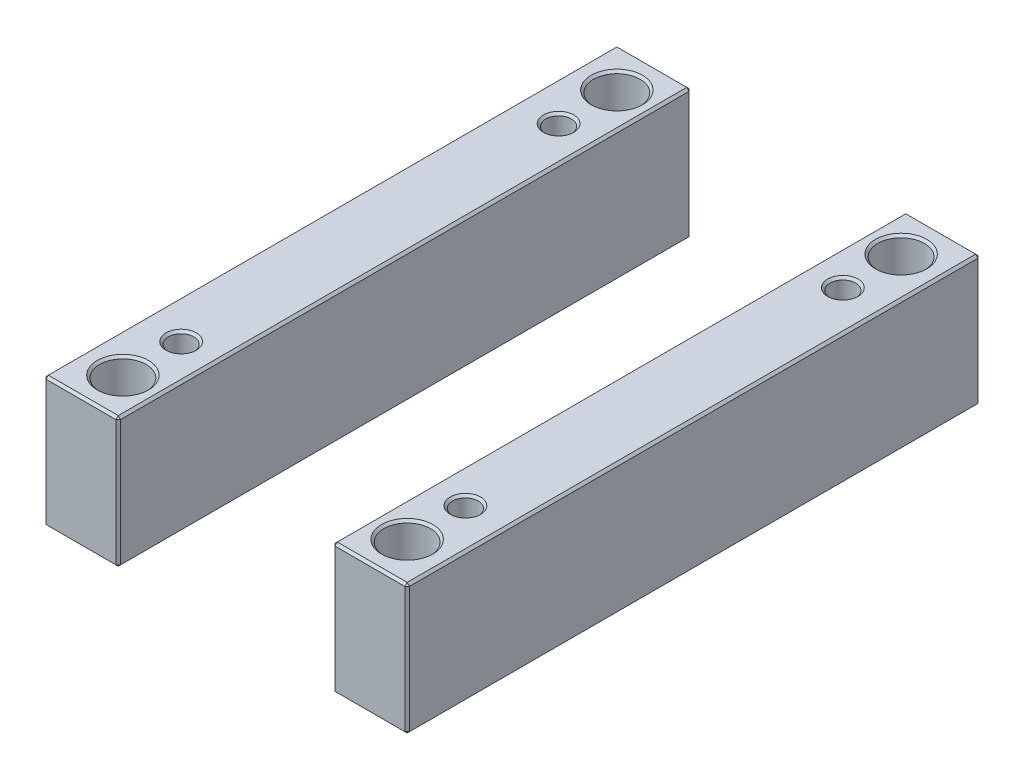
ISO-10303-21;
HEADER;
FILE_DESCRIPTION(('STEP AP214'),'2;1');
FILE_NAME('part.step','',(''),(''),'','','');
FILE_SCHEMA(('AUTOMOTIVE_DESIGN { 1 0 10303 214 1 1 1 1 }'));
ENDSEC;
DATA;
#1=APPLICATION_CONTEXT('core data for automotive mechanical design processes');
#2=APPLICATION_PROTOCOL_DEFINITION('international standard','automotive_design',2000,#1);
#3=PRODUCT_CONTEXT('',#1,'mechanical');
#4=PRODUCT('Part','Part','',(#3));
#5=PRODUCT_RELATED_PRODUCT_CATEGORY('part','',(#4));
#6=PRODUCT_DEFINITION_FORMATION('','',#4);
#7=PRODUCT_DEFINITION_CONTEXT('part definition',#1,'design');
#8=PRODUCT_DEFINITION('design','',#6,#7);
#9=PRODUCT_DEFINITION_SHAPE('','',#8);
#10=(LENGTH_UNIT() NAMED_UNIT(*) SI_UNIT(.MILLI.,.METRE.));
#11=(NAMED_UNIT(*) PLANE_ANGLE_UNIT() SI_UNIT($,.RADIAN.));
#12=(NAMED_UNIT(*) SI_UNIT($,.STERADIAN.) SOLID_ANGLE_UNIT());
#13=UNCERTAINTY_MEASURE_WITH_UNIT(LENGTH_MEASURE(1.E-05),#10,'distance_accuracy_value','');
#14=(GEOMETRIC_REPRESENTATION_CONTEXT(3) GLOBAL_UNCERTAINTY_ASSIGNED_CONTEXT((#13)) GLOBAL_UNIT_ASSIGNED_CONTEXT((#10,
#11,#12)) REPRESENTATION_CONTEXT('',''));
#15=CARTESIAN_POINT('',(0.,0.,0.));
#16=DIRECTION('',(0.,0.,1.));
#17=DIRECTION('',(1.,0.,0.));
#18=AXIS2_PLACEMENT_3D('',#15,#16,#17);
#19=CARTESIAN_POINT('',(-78.,56.,-123.));
#20=DIRECTION('',(0.,0.,1.));
#21=DIRECTION('',(1.,0.,0.));
#22=AXIS2_PLACEMENT_3D('',#19,#20,#21);
#23=PLANE('',#22);
#24=DIRECTION('',(-1.,0.,0.));
#25=VECTOR('',#24,1.);
#26=CARTESIAN_POINT('',(-78.,1.00000000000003,-123.));
#27=LINE('',#26,#25);
#28=CARTESIAN_POINT('',(-47.,1.00000000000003,-123.));
#29=VERTEX_POINT('',#28);
#30=CARTESIAN_POINT('',(-77.,1.00000000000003,-123.));
#31=VERTEX_POINT('',#30);
#32=EDGE_CURVE('P0_E137',#29,#31,#27,.T.);
#33=ORIENTED_EDGE('',*,*,#32,.T.);
#34=DIRECTION('',(0.,1.,0.));
#35=VECTOR('',#34,1.);
#36=CARTESIAN_POINT('',(-77.,56.,-123.));
#37=LINE('',#36,#35);
#38=CARTESIAN_POINT('',(-77.,55.,-123.));
#39=VERTEX_POINT('',#38);
#40=EDGE_CURVE('P0_E265',#31,#39,#37,.T.);
#41=ORIENTED_EDGE('',*,*,#40,.T.);
#42=DIRECTION('',(1.,0.,0.));
#43=VECTOR('',#42,1.);
#44=CARTESIAN_POINT('',(-78.,55.,-123.));
#45=LINE('',#44,#43);
#46=CARTESIAN_POINT('',(-47.,55.,-123.));
#47=VERTEX_POINT('',#46);
#48=EDGE_CURVE('P0_E263',#39,#47,#45,.T.);
#49=ORIENTED_EDGE('',*,*,#48,.T.);
#50=DIRECTION('',(0.,-1.,0.));
#51=VECTOR('',#50,1.);
#52=CARTESIAN_POINT('',(-47.,56.,-123.));
#53=LINE('',#52,#51);
#54=EDGE_CURVE('P0_E260',#47,#29,#53,.T.);
#55=ORIENTED_EDGE('',*,*,#54,.T.);
#56=EDGE_LOOP('',(#33,#41,#49,#55));
#57=FACE_BOUND('',#56,.T.);
#58=ADVANCED_FACE('P0_F16',(#57),#23,.F.);
#59=CARTESIAN_POINT('',(-78.,56.,123.));
#60=DIRECTION('',(1.,0.,0.));
#61=DIRECTION('',(0.,0.,-1.));
#62=AXIS2_PLACEMENT_3D('',#59,#60,#61);
#63=PLANE('',#62);
#64=DIRECTION('',(0.,1.,0.));
#65=VECTOR('',#64,1.);
#66=CARTESIAN_POINT('',(-78.,56.,122.));
#67=LINE('',#66,#65);
#68=CARTESIAN_POINT('',(-78.,1.00000000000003,122.));
#69=VERTEX_POINT('',#68);
#70=CARTESIAN_POINT('',(-78.,55.,122.));
#71=VERTEX_POINT('',#70);
#72=EDGE_CURVE('P0_E253',#69,#71,#67,.T.);
#73=ORIENTED_EDGE('',*,*,#72,.T.);
#74=DIRECTION('',(0.,0.,-1.));
#75=VECTOR('',#74,1.);
#76=CARTESIAN_POINT('',(-78.,55.,123.));
#77=LINE('',#76,#75);
#78=CARTESIAN_POINT('',(-78.,55.,-122.));
#79=VERTEX_POINT('',#78);
#80=EDGE_CURVE('P0_E258',#71,#79,#77,.T.);
#81=ORIENTED_EDGE('',*,*,#80,.T.);
#82=DIRECTION('',(0.,-1.,0.));
#83=VECTOR('',#82,1.);
#84=CARTESIAN_POINT('',(-78.,56.,-122.));
#85=LINE('',#84,#83);
#86=CARTESIAN_POINT('',(-78.,1.00000000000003,-122.));
#87=VERTEX_POINT('',#86);
#88=EDGE_CURVE('P0_E255',#79,#87,#85,.T.);
#89=ORIENTED_EDGE('',*,*,#88,.T.);
#90=DIRECTION('',(0.,0.,1.));
#91=VECTOR('',#90,1.);
#92=CARTESIAN_POINT('',(-78.,1.00000000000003,123.));
#93=LINE('',#92,#91);
#94=EDGE_CURVE('P0_E251',#87,#69,#93,.T.);
#95=ORIENTED_EDGE('',*,*,#94,.T.);
#96=EDGE_LOOP('',(#73,#81,#89,#95));
#97=FACE_BOUND('',#96,.T.);
#98=ADVANCED_FACE('P0_F333',(#97),#63,.F.);
#99=CARTESIAN_POINT('',(-78.,56.,123.));
#100=DIRECTION('',(0.,0.,-1.));
#101=DIRECTION('',(-1.,0.,0.));
#102=AXIS2_PLACEMENT_3D('',#99,#100,#101);
#103=PLANE('',#102);
#104=DIRECTION('',(-1.,0.,0.));
#105=VECTOR('',#104,1.);
#106=CARTESIAN_POINT('',(-78.,55.,123.));
#107=LINE('',#106,#105);
#108=CARTESIAN_POINT('',(-47.,55.,123.));
#109=VERTEX_POINT('',#108);
#110=CARTESIAN_POINT('',(-77.,55.,123.));
#111=VERTEX_POINT('',#110);
#112=EDGE_CURVE('P0_E272',#109,#111,#107,.T.);
#113=ORIENTED_EDGE('',*,*,#112,.T.);
#114=DIRECTION('',(0.,-1.,0.));
#115=VECTOR('',#114,1.);
#116=CARTESIAN_POINT('',(-77.,56.,123.));
#117=LINE('',#116,#115);
#118=CARTESIAN_POINT('',(-77.,1.00000000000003,123.));
#119=VERTEX_POINT('',#118);
#120=EDGE_CURVE('P0_E274',#111,#119,#117,.T.);
#121=ORIENTED_EDGE('',*,*,#120,.T.);
#122=DIRECTION('',(1.,0.,0.));
#123=VECTOR('',#122,1.);
#124=CARTESIAN_POINT('',(-46.,1.00000000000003,123.));
#125=LINE('',#124,#123);
#126=CARTESIAN_POINT('',(-47.,1.00000000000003,123.));
#127=VERTEX_POINT('',#126);
#128=EDGE_CURVE('P0_E270',#119,#127,#125,.T.);
#129=ORIENTED_EDGE('',*,*,#128,.T.);
#130=DIRECTION('',(0.,1.,0.));
#131=VECTOR('',#130,1.);
#132=CARTESIAN_POINT('',(-47.,56.,123.));
#133=LINE('',#132,#131);
#134=EDGE_CURVE('P0_E268',#127,#109,#133,.T.);
#135=ORIENTED_EDGE('',*,*,#134,.T.);
#136=EDGE_LOOP('',(#113,#121,#129,#135));
#137=FACE_BOUND('',#136,.T.);
#138=ADVANCED_FACE('P0_F372',(#137),#103,.F.);
#139=CARTESIAN_POINT('',(-46.,56.,-123.));
#140=DIRECTION('',(-1.,0.,0.));
#141=DIRECTION('',(0.,0.,1.));
#142=AXIS2_PLACEMENT_3D('',#139,#140,#141);
#143=PLANE('',#142);
#144=DIRECTION('',(0.,0.,1.));
#145=VECTOR('',#144,1.);
#146=CARTESIAN_POINT('',(-46.,55.,-123.));
#147=LINE('',#146,#145);
#148=CARTESIAN_POINT('',(-46.,55.,-122.));
#149=VERTEX_POINT('',#148);
#150=CARTESIAN_POINT('',(-46.,55.,122.));
#151=VERTEX_POINT('',#150);
#152=EDGE_CURVE('P0_E31',#149,#151,#147,.T.);
#153=ORIENTED_EDGE('',*,*,#152,.T.);
#154=DIRECTION('',(0.,-1.,0.));
#155=VECTOR('',#154,1.);
#156=CARTESIAN_POINT('',(-46.,56.,122.));
#157=LINE('',#156,#155);
#158=CARTESIAN_POINT('',(-46.,1.00000000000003,122.));
#159=VERTEX_POINT('',#158);
#160=EDGE_CURVE('P0_E190',#151,#159,#157,.T.);
#161=ORIENTED_EDGE('',*,*,#160,.T.);
#162=DIRECTION('',(0.,0.,-1.));
#163=VECTOR('',#162,1.);
#164=CARTESIAN_POINT('',(-46.,1.00000000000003,-123.));
#165=LINE('',#164,#163);
#166=CARTESIAN_POINT('',(-46.,1.00000000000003,-122.));
#167=VERTEX_POINT('',#166);
#168=EDGE_CURVE('P0_E286',#159,#167,#165,.T.);
#169=ORIENTED_EDGE('',*,*,#168,.T.);
#170=DIRECTION('',(0.,1.,0.));
#171=VECTOR('',#170,1.);
#172=CARTESIAN_POINT('',(-46.,56.,-122.));
#173=LINE('',#172,#171);
#174=EDGE_CURVE('P0_E36',#167,#149,#173,.T.);
#175=ORIENTED_EDGE('',*,*,#174,.T.);
#176=EDGE_LOOP('',(#153,#161,#169,#175));
#177=FACE_BOUND('',#176,.T.);
#178=ADVANCED_FACE('P0_F649',(#177),#143,.F.);
#179=CARTESIAN_POINT('',(0.,56.,0.));
#180=DIRECTION('',(0.,-1.,0.));
#181=DIRECTION('',(0.,0.,-1.));
#182=AXIS2_PLACEMENT_3D('',#179,#180,#181);
#183=PLANE('',#182);
#184=CARTESIAN_POINT('',(-61.,56.,-106.));
#185=DIRECTION('',(0.,-1.,0.));
#186=DIRECTION('',(0.,0.,-1.));
#187=AXIS2_PLACEMENT_3D('',#184,#185,#186);
#188=CIRCLE('',#187,11.);
#189=CARTESIAN_POINT('',(-61.,56.,-117.));
#190=VERTEX_POINT('',#189);
#191=EDGE_CURVE('P0_E214',#190,#190,#188,.T.);
#192=ORIENTED_EDGE('',*,*,#191,.T.);
#193=EDGE_LOOP('',(#192));
#194=FACE_BOUND('',#193,.T.);
#195=CARTESIAN_POINT('',(-61.,56.,106.));
#196=DIRECTION('',(0.,-1.,0.));
#197=DIRECTION('',(0.,0.,-1.));
#198=AXIS2_PLACEMENT_3D('',#195,#196,#197);
#199=CIRCLE('',#198,11.);
#200=CARTESIAN_POINT('',(-61.,56.,95.));
#201=VERTEX_POINT('',#200);
#202=EDGE_CURVE('P0_E211',#201,#201,#199,.T.);
#203=ORIENTED_EDGE('',*,*,#202,.T.);
#204=EDGE_LOOP('',(#203));
#205=FACE_BOUND('',#204,.T.);
#206=CARTESIAN_POINT('',(-61.,56.,81.));
#207=DIRECTION('',(0.,-1.,0.));
#208=DIRECTION('',(0.,0.,-1.));
#209=AXIS2_PLACEMENT_3D('',#206,#207,#208);
#210=CIRCLE('',#209,6.5);
#211=CARTESIAN_POINT('',(-61.,56.,74.5));
#212=VERTEX_POINT('',#211);
#213=EDGE_CURVE('P0_E193',#212,#212,#210,.T.);
#214=ORIENTED_EDGE('',*,*,#213,.T.);
#215=EDGE_LOOP('',(#214));
#216=FACE_BOUND('',#215,.T.);
#217=CARTESIAN_POINT('',(-61.,56.,-81.));
#218=DIRECTION('',(0.,-1.,0.));
#219=DIRECTION('',(0.,0.,-1.));
#220=AXIS2_PLACEMENT_3D('',#217,#218,#219);
#221=CIRCLE('',#220,6.5);
#222=CARTESIAN_POINT('',(-61.,56.,-87.5));
#223=VERTEX_POINT('',#222);
#224=EDGE_CURVE('P0_E189',#223,#223,#221,.T.);
#225=ORIENTED_EDGE('',*,*,#224,.T.);
#226=EDGE_LOOP('',(#225));
#227=FACE_BOUND('',#226,.T.);
#228=DIRECTION('',(0.,0.,1.));
#229=VECTOR('',#228,1.);
#230=CARTESIAN_POINT('',(-77.,56.,0.));
#231=LINE('',#230,#229);
#232=CARTESIAN_POINT('',(-77.,56.,-122.));
#233=VERTEX_POINT('',#232);
#234=CARTESIAN_POINT('',(-77.,56.,122.));
#235=VERTEX_POINT('',#234);
#236=EDGE_CURVE('P0_E281',#233,#235,#231,.T.);
#237=ORIENTED_EDGE('',*,*,#236,.T.);
#238=DIRECTION('',(1.,0.,0.));
#239=VECTOR('',#238,1.);
#240=CARTESIAN_POINT('',(0.,56.,122.));
#241=LINE('',#240,#239);
#242=CARTESIAN_POINT('',(-47.,56.,122.));
#243=VERTEX_POINT('',#242);
#244=EDGE_CURVE('P0_E283',#235,#243,#241,.T.);
#245=ORIENTED_EDGE('',*,*,#244,.T.);
#246=DIRECTION('',(0.,0.,-1.));
#247=VECTOR('',#246,1.);
#248=CARTESIAN_POINT('',(-47.,56.,0.));
#249=LINE('',#248,#247);
#250=CARTESIAN_POINT('',(-47.,56.,-122.));
#251=VERTEX_POINT('',#250);
#252=EDGE_CURVE('P0_E277',#243,#251,#249,.T.);
#253=ORIENTED_EDGE('',*,*,#252,.T.);
#254=DIRECTION('',(-1.,0.,0.));
#255=VECTOR('',#254,1.);
#256=CARTESIAN_POINT('',(0.,56.,-122.));
#257=LINE('',#256,#255);
#258=EDGE_CURVE('P0_E279',#251,#233,#257,.T.);
#259=ORIENTED_EDGE('',*,*,#258,.T.);
#260=EDGE_LOOP('',(#237,#245,#253,#259));
#261=FACE_BOUND('',#260,.T.);
#262=ADVANCED_FACE('P0_F229',(#194,#205,#216,#227,#261),#183,.F.);
#263=CARTESIAN_POINT('',(0.,0.,0.));
#264=DIRECTION('',(0.,-1.,0.));
#265=DIRECTION('',(0.,0.,-1.));
#266=AXIS2_PLACEMENT_3D('',#263,#264,#265);
#267=PLANE('',#266);
#268=CARTESIAN_POINT('',(-61.,0.,-106.));
#269=DIRECTION('',(0.,-1.,0.));
#270=DIRECTION('',(0.,0.,-1.));
#271=AXIS2_PLACEMENT_3D('',#268,#269,#270);
#272=CIRCLE('',#271,11.);
#273=CARTESIAN_POINT('',(-61.,0.,-117.));
#274=VERTEX_POINT('',#273);
#275=EDGE_CURVE('P0_E202',#274,#274,#272,.F.);
#276=ORIENTED_EDGE('',*,*,#275,.T.);
#277=EDGE_LOOP('',(#276));
#278=FACE_BOUND('',#277,.T.);
#279=CARTESIAN_POINT('',(-61.,0.,106.));
#280=DIRECTION('',(0.,-1.,0.));
#281=DIRECTION('',(0.,0.,-1.));
#282=AXIS2_PLACEMENT_3D('',#279,#280,#281);
#283=CIRCLE('',#282,11.);
#284=CARTESIAN_POINT('',(-61.,0.,95.));
#285=VERTEX_POINT('',#284);
#286=EDGE_CURVE('P0_E199',#285,#285,#283,.F.);
#287=ORIENTED_EDGE('',*,*,#286,.T.);
#288=EDGE_LOOP('',(#287));
#289=FACE_BOUND('',#288,.T.);
#290=CARTESIAN_POINT('',(-61.,0.,-81.));
#291=DIRECTION('',(0.,-1.,0.));
#292=DIRECTION('',(0.,0.,-1.));
#293=AXIS2_PLACEMENT_3D('',#290,#291,#292);
#294=CIRCLE('',#293,6.5);
#295=CARTESIAN_POINT('',(-61.,0.,-87.5));
#296=VERTEX_POINT('',#295);
#297=EDGE_CURVE('P0_E235',#296,#296,#294,.F.);
#298=ORIENTED_EDGE('',*,*,#297,.T.);
#299=EDGE_LOOP('',(#298));
#300=FACE_BOUND('',#299,.T.);
#301=CARTESIAN_POINT('',(-61.,0.,81.));
#302=DIRECTION('',(0.,-1.,0.));
#303=DIRECTION('',(0.,0.,-1.));
#304=AXIS2_PLACEMENT_3D('',#301,#302,#303);
#305=CIRCLE('',#304,6.5);
#306=CARTESIAN_POINT('',(-61.,0.,74.5));
#307=VERTEX_POINT('',#306);
#308=EDGE_CURVE('P0_E238',#307,#307,#305,.F.);
#309=ORIENTED_EDGE('',*,*,#308,.T.);
#310=EDGE_LOOP('',(#309));
#311=FACE_BOUND('',#310,.T.);
#312=DIRECTION('',(-1.,0.,0.));
#313=VECTOR('',#312,1.);
#314=CARTESIAN_POINT('',(-78.,0.,122.));
#315=LINE('',#314,#313);
#316=CARTESIAN_POINT('',(-47.,0.,122.));
#317=VERTEX_POINT('',#316);
#318=CARTESIAN_POINT('',(-77.,0.,122.));
#319=VERTEX_POINT('',#318);
#320=EDGE_CURVE('P0_E114',#317,#319,#315,.T.);
#321=ORIENTED_EDGE('',*,*,#320,.T.);
#322=DIRECTION('',(0.,0.,-1.));
#323=VECTOR('',#322,1.);
#324=CARTESIAN_POINT('',(-77.,0.,-123.));
#325=LINE('',#324,#323);
#326=CARTESIAN_POINT('',(-77.,0.,-122.));
#327=VERTEX_POINT('',#326);
#328=EDGE_CURVE('P0_E110',#319,#327,#325,.T.);
#329=ORIENTED_EDGE('',*,*,#328,.T.);
#330=DIRECTION('',(1.,0.,0.));
#331=VECTOR('',#330,1.);
#332=CARTESIAN_POINT('',(-46.,0.,-122.));
#333=LINE('',#332,#331);
#334=CARTESIAN_POINT('',(-47.,0.,-122.));
#335=VERTEX_POINT('',#334);
#336=EDGE_CURVE('P0_E104',#327,#335,#333,.T.);
#337=ORIENTED_EDGE('',*,*,#336,.T.);
#338=DIRECTION('',(0.,0.,1.));
#339=VECTOR('',#338,1.);
#340=CARTESIAN_POINT('',(-47.,0.,123.));
#341=LINE('',#340,#339);
#342=EDGE_CURVE('P0_E107',#335,#317,#341,.T.);
#343=ORIENTED_EDGE('',*,*,#342,.T.);
#344=EDGE_LOOP('',(#321,#329,#337,#343));
#345=FACE_BOUND('',#344,.T.);
#346=ADVANCED_FACE('P0_F106',(#278,#289,#300,#311,#345),#267,.T.);
#347=CARTESIAN_POINT('',(-61.,0.,-81.));
#348=DIRECTION('',(0.,1.,0.));
#349=DIRECTION('',(0.,0.,1.));
#350=AXIS2_PLACEMENT_3D('',#347,#348,#349);
#351=CYLINDRICAL_SURFACE('',#350,5.5);
#352=CARTESIAN_POINT('',(-61.,55.,-81.));
#353=DIRECTION('',(0.,-1.,0.));
#354=DIRECTION('',(0.,0.,-1.));
#355=AXIS2_PLACEMENT_3D('',#352,#353,#354);
#356=CIRCLE('',#355,5.5);
#357=CARTESIAN_POINT('',(-61.,55.,-86.5));
#358=VERTEX_POINT('',#357);
#359=EDGE_CURVE('P0_E196',#358,#358,#356,.F.);
#360=ORIENTED_EDGE('',*,*,#359,.T.);
#361=EDGE_LOOP('',(#360));
#362=FACE_BOUND('',#361,.T.);
#363=CARTESIAN_POINT('',(-61.,1.00000000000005,-81.));
#364=DIRECTION('',(0.,-1.,0.));
#365=DIRECTION('',(0.,0.,-1.));
#366=AXIS2_PLACEMENT_3D('',#363,#364,#365);
#367=CIRCLE('',#366,5.5);
#368=CARTESIAN_POINT('',(-61.,1.00000000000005,-86.5));
#369=VERTEX_POINT('',#368);
#370=EDGE_CURVE('P0_E241',#369,#369,#367,.T.);
#371=ORIENTED_EDGE('',*,*,#370,.T.);
#372=EDGE_LOOP('',(#371));
#373=FACE_BOUND('',#372,.T.);
#374=ADVANCED_FACE('P0_F228',(#362,#373),#351,.F.);
#375=CARTESIAN_POINT('',(-61.,0.,81.));
#376=DIRECTION('',(0.,1.,0.));
#377=DIRECTION('',(0.,0.,1.));
#378=AXIS2_PLACEMENT_3D('',#375,#376,#377);
#379=CYLINDRICAL_SURFACE('',#378,5.5);
#380=CARTESIAN_POINT('',(-61.,55.,81.));
#381=DIRECTION('',(0.,-1.,0.));
#382=DIRECTION('',(0.,0.,-1.));
#383=AXIS2_PLACEMENT_3D('',#380,#381,#382);
#384=CIRCLE('',#383,5.5);
#385=CARTESIAN_POINT('',(-61.,55.,75.5));
#386=VERTEX_POINT('',#385);
#387=EDGE_CURVE('P0_E186',#386,#386,#384,.F.);
#388=ORIENTED_EDGE('',*,*,#387,.T.);
#389=EDGE_LOOP('',(#388));
#390=FACE_BOUND('',#389,.T.);
#391=CARTESIAN_POINT('',(-61.,1.00000000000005,81.));
#392=DIRECTION('',(0.,-1.,0.));
#393=DIRECTION('',(0.,0.,-1.));
#394=AXIS2_PLACEMENT_3D('',#391,#392,#393);
#395=CIRCLE('',#394,5.5);
#396=CARTESIAN_POINT('',(-61.,1.00000000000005,75.5));
#397=VERTEX_POINT('',#396);
#398=EDGE_CURVE('P0_E248',#397,#397,#395,.T.);
#399=ORIENTED_EDGE('',*,*,#398,.T.);
#400=EDGE_LOOP('',(#399));
#401=FACE_BOUND('',#400,.T.);
#402=ADVANCED_FACE('P0_F380',(#390,#401),#379,.F.);
#403=CARTESIAN_POINT('',(-61.,0.,-81.));
#404=DIRECTION('',(0.,-1.,0.));
#405=DIRECTION('',(0.,0.,-1.));
#406=AXIS2_PLACEMENT_3D('',#403,#404,#405);
#407=CONICAL_SURFACE('',#406,6.5,0.785398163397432);
#408=ORIENTED_EDGE('',*,*,#370,.F.);
#409=EDGE_LOOP('',(#408));
#410=FACE_BOUND('',#409,.T.);
#411=ORIENTED_EDGE('',*,*,#297,.F.);
#412=EDGE_LOOP('',(#411));
#413=FACE_BOUND('',#412,.T.);
#414=ADVANCED_FACE('P0_F376',(#410,#413),#407,.F.);
#415=CARTESIAN_POINT('',(-61.,0.,81.));
#416=DIRECTION('',(0.,-1.,0.));
#417=DIRECTION('',(0.,0.,-1.));
#418=AXIS2_PLACEMENT_3D('',#415,#416,#417);
#419=CONICAL_SURFACE('',#418,6.5,0.785398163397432);
#420=ORIENTED_EDGE('',*,*,#398,.F.);
#421=EDGE_LOOP('',(#420));
#422=FACE_BOUND('',#421,.T.);
#423=ORIENTED_EDGE('',*,*,#308,.F.);
#424=EDGE_LOOP('',(#423));
#425=FACE_BOUND('',#424,.T.);
#426=ADVANCED_FACE('P0_F379',(#422,#425),#419,.F.);
#427=CARTESIAN_POINT('',(-46.,56.,122.));
#428=DIRECTION('',(-0.707106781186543,0.,-0.707106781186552));
#429=DIRECTION('',(0.,-1.,0.));
#430=AXIS2_PLACEMENT_3D('',#427,#428,#429);
#431=PLANE('',#430);
#432=DIRECTION('',(-0.707106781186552,0.,0.707106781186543));
#433=VECTOR('',#432,1.);
#434=CARTESIAN_POINT('',(-46.5,55.,122.5));
#435=LINE('',#434,#433);
#436=EDGE_CURVE('P0_E125',#109,#151,#435,.F.);
#437=ORIENTED_EDGE('',*,*,#436,.F.);
#438=ORIENTED_EDGE('',*,*,#134,.F.);
#439=DIRECTION('',(0.707106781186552,0.,-0.707106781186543));
#440=VECTOR('',#439,1.);
#441=CARTESIAN_POINT('',(-47.,1.00000000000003,123.));
#442=LINE('',#441,#440);
#443=EDGE_CURVE('P0_E181',#159,#127,#442,.F.);
#444=ORIENTED_EDGE('',*,*,#443,.F.);
#445=ORIENTED_EDGE('',*,*,#160,.F.);
#446=EDGE_LOOP('',(#437,#438,#444,#445));
#447=FACE_BOUND('',#446,.T.);
#448=ADVANCED_FACE('P0_F384',(#447),#431,.F.);
#449=CARTESIAN_POINT('',(-47.,56.,122.));
#450=DIRECTION('',(0.577350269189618,0.577350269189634,0.577350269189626));
#451=DIRECTION('',(0.,-0.707106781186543,0.707106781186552));
#452=AXIS2_PLACEMENT_3D('',#449,#450,#451);
#453=PLANE('',#452);
#454=DIRECTION('',(0.,0.707106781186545,-0.70710678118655));
#455=VECTOR('',#454,1.);
#456=CARTESIAN_POINT('',(-47.,56.,122.));
#457=LINE('',#456,#455);
#458=EDGE_CURVE('P0_E175',#109,#243,#457,.T.);
#459=ORIENTED_EDGE('',*,*,#458,.F.);
#460=ORIENTED_EDGE('',*,*,#436,.T.);
#461=DIRECTION('',(0.707106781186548,-0.707106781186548,0.));
#462=VECTOR('',#461,1.);
#463=CARTESIAN_POINT('',(-47.,56.,122.));
#464=LINE('',#463,#462);
#465=EDGE_CURVE('P0_E178',#243,#151,#464,.T.);
#466=ORIENTED_EDGE('',*,*,#465,.F.);
#467=EDGE_LOOP('',(#459,#460,#466));
#468=FACE_BOUND('',#467,.T.);
#469=ADVANCED_FACE('P0_F588',(#468),#453,.T.);
#470=CARTESIAN_POINT('',(-47.,1.00000000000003,123.));
#471=DIRECTION('',(0.577350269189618,-0.577350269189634,0.577350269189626));
#472=DIRECTION('',(0.,-0.707106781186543,-0.707106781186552));
#473=AXIS2_PLACEMENT_3D('',#470,#471,#472);
#474=PLANE('',#473);
#475=DIRECTION('',(0.707106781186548,0.707106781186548,0.));
#476=VECTOR('',#475,1.);
#477=CARTESIAN_POINT('',(-46.5,0.500000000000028,122.));
#478=LINE('',#477,#476);
#479=EDGE_CURVE('P0_E123',#159,#317,#478,.F.);
#480=ORIENTED_EDGE('',*,*,#479,.F.);
#481=ORIENTED_EDGE('',*,*,#443,.T.);
#482=DIRECTION('',(0.,-0.707106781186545,-0.70710678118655));
#483=VECTOR('',#482,1.);
#484=CARTESIAN_POINT('',(-47.,1.00000000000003,123.));
#485=LINE('',#484,#483);
#486=EDGE_CURVE('P0_E172',#317,#127,#485,.F.);
#487=ORIENTED_EDGE('',*,*,#486,.F.);
#488=EDGE_LOOP('',(#480,#481,#487));
#489=FACE_BOUND('',#488,.T.);
#490=ADVANCED_FACE('P0_F597',(#489),#474,.T.);
#491=CARTESIAN_POINT('',(-47.,56.,0.));
#492=DIRECTION('',(-0.707106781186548,-0.707106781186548,0.));
#493=DIRECTION('',(0.,0.,-1.));
#494=AXIS2_PLACEMENT_3D('',#491,#492,#493);
#495=PLANE('',#494);
#496=ORIENTED_EDGE('',*,*,#465,.T.);
#497=ORIENTED_EDGE('',*,*,#152,.F.);
#498=DIRECTION('',(-0.707106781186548,0.707106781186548,0.));
#499=VECTOR('',#498,1.);
#500=CARTESIAN_POINT('',(-46.5,55.5,-122.));
#501=LINE('',#500,#499);
#502=EDGE_CURVE('P0_E165',#251,#149,#501,.F.);
#503=ORIENTED_EDGE('',*,*,#502,.F.);
#504=ORIENTED_EDGE('',*,*,#252,.F.);
#505=EDGE_LOOP('',(#496,#497,#503,#504));
#506=FACE_BOUND('',#505,.T.);
#507=ADVANCED_FACE('P0_F349',(#506),#495,.F.);
#508=CARTESIAN_POINT('',(0.,56.,122.));
#509=DIRECTION('',(0.,-0.70710678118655,-0.707106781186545));
#510=DIRECTION('',(1.,0.,0.));
#511=AXIS2_PLACEMENT_3D('',#508,#509,#510);
#512=PLANE('',#511);
#513=ORIENTED_EDGE('',*,*,#458,.T.);
#514=ORIENTED_EDGE('',*,*,#244,.F.);
#515=DIRECTION('',(0.,-0.707106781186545,0.70710678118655));
#516=VECTOR('',#515,1.);
#517=CARTESIAN_POINT('',(-77.,55.5,122.5));
#518=LINE('',#517,#516);
#519=EDGE_CURVE('P0_E162',#111,#235,#518,.F.);
#520=ORIENTED_EDGE('',*,*,#519,.F.);
#521=ORIENTED_EDGE('',*,*,#112,.F.);
#522=EDGE_LOOP('',(#513,#514,#520,#521));
#523=FACE_BOUND('',#522,.T.);
#524=ADVANCED_FACE('P0_F344',(#523),#512,.F.);
#525=CARTESIAN_POINT('',(-77.,56.,123.));
#526=DIRECTION('',(0.707106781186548,0.,-0.707106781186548));
#527=DIRECTION('',(0.,-1.,0.));
#528=AXIS2_PLACEMENT_3D('',#525,#526,#527);
#529=PLANE('',#528);
#530=DIRECTION('',(0.707106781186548,0.,0.707106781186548));
#531=VECTOR('',#530,1.);
#532=CARTESIAN_POINT('',(-77.,1.00000000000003,123.));
#533=LINE('',#532,#531);
#534=EDGE_CURVE('P0_E156',#119,#69,#533,.F.);
#535=ORIENTED_EDGE('',*,*,#534,.F.);
#536=ORIENTED_EDGE('',*,*,#120,.F.);
#537=DIRECTION('',(-0.707106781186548,0.,-0.707106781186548));
#538=VECTOR('',#537,1.);
#539=CARTESIAN_POINT('',(-78.,55.,122.));
#540=LINE('',#539,#538);
#541=EDGE_CURVE('P0_E159',#71,#111,#540,.F.);
#542=ORIENTED_EDGE('',*,*,#541,.F.);
#543=ORIENTED_EDGE('',*,*,#72,.F.);
#544=EDGE_LOOP('',(#535,#536,#542,#543));
#545=FACE_BOUND('',#544,.T.);
#546=ADVANCED_FACE('P0_F338',(#545),#529,.F.);
#547=CARTESIAN_POINT('',(-78.,1.00000000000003,123.));
#548=DIRECTION('',(0.,-0.70710678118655,0.707106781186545));
#549=DIRECTION('',(-1.,0.,0.));
#550=AXIS2_PLACEMENT_3D('',#547,#548,#549);
#551=PLANE('',#550);
#552=ORIENTED_EDGE('',*,*,#486,.T.);
#553=ORIENTED_EDGE('',*,*,#128,.F.);
#554=DIRECTION('',(0.,0.707106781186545,0.70710678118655));
#555=VECTOR('',#554,1.);
#556=CARTESIAN_POINT('',(-77.,1.00000000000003,123.));
#557=LINE('',#556,#555);
#558=EDGE_CURVE('P0_E134',#319,#119,#557,.T.);
#559=ORIENTED_EDGE('',*,*,#558,.F.);
#560=ORIENTED_EDGE('',*,*,#320,.F.);
#561=EDGE_LOOP('',(#552,#553,#559,#560));
#562=FACE_BOUND('',#561,.T.);
#563=ADVANCED_FACE('P0_F364',(#562),#551,.T.);
#564=CARTESIAN_POINT('',(-46.,1.00000000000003,-123.));
#565=DIRECTION('',(0.707106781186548,-0.707106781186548,0.));
#566=DIRECTION('',(0.,0.,1.));
#567=AXIS2_PLACEMENT_3D('',#564,#565,#566);
#568=PLANE('',#567);
#569=ORIENTED_EDGE('',*,*,#479,.T.);
#570=ORIENTED_EDGE('',*,*,#342,.F.);
#571=DIRECTION('',(-0.707106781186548,-0.707106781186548,0.));
#572=VECTOR('',#571,1.);
#573=CARTESIAN_POINT('',(-47.,0.,-122.));
#574=LINE('',#573,#572);
#575=EDGE_CURVE('P0_E120',#167,#335,#574,.T.);
#576=ORIENTED_EDGE('',*,*,#575,.F.);
#577=ORIENTED_EDGE('',*,*,#168,.F.);
#578=EDGE_LOOP('',(#569,#570,#576,#577));
#579=FACE_BOUND('',#578,.T.);
#580=ADVANCED_FACE('P0_F119',(#579),#568,.T.);
#581=CARTESIAN_POINT('',(-47.,56.,-123.));
#582=DIRECTION('',(-0.707106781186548,0.,0.707106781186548));
#583=DIRECTION('',(0.,-1.,0.));
#584=AXIS2_PLACEMENT_3D('',#581,#582,#583);
#585=PLANE('',#584);
#586=DIRECTION('',(0.707106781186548,0.,0.707106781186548));
#587=VECTOR('',#586,1.);
#588=CARTESIAN_POINT('',(-47.,55.,-123.));
#589=LINE('',#588,#587);
#590=EDGE_CURVE('P0_E168',#149,#47,#589,.F.);
#591=ORIENTED_EDGE('',*,*,#590,.F.);
#592=ORIENTED_EDGE('',*,*,#174,.F.);
#593=DIRECTION('',(-0.707106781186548,0.,-0.707106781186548));
#594=VECTOR('',#593,1.);
#595=CARTESIAN_POINT('',(-46.5,1.00000000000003,-122.5));
#596=LINE('',#595,#594);
#597=EDGE_CURVE('P0_E133',#29,#167,#596,.F.);
#598=ORIENTED_EDGE('',*,*,#597,.F.);
#599=ORIENTED_EDGE('',*,*,#54,.F.);
#600=EDGE_LOOP('',(#591,#592,#598,#599));
#601=FACE_BOUND('',#600,.T.);
#602=ADVANCED_FACE('P0_F354',(#601),#585,.F.);
#603=CARTESIAN_POINT('',(-47.,55.,-123.));
#604=DIRECTION('',(0.577350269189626,0.577350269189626,-0.577350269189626));
#605=DIRECTION('',(-0.707106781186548,0.,-0.707106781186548));
#606=AXIS2_PLACEMENT_3D('',#603,#604,#605);
#607=PLANE('',#606);
#608=ORIENTED_EDGE('',*,*,#502,.T.);
#609=ORIENTED_EDGE('',*,*,#590,.T.);
#610=DIRECTION('',(0.,-0.707106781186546,-0.70710678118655));
#611=VECTOR('',#610,1.);
#612=CARTESIAN_POINT('',(-47.,55.,-123.));
#613=LINE('',#612,#611);
#614=EDGE_CURVE('P0_E151',#251,#47,#613,.T.);
#615=ORIENTED_EDGE('',*,*,#614,.F.);
#616=EDGE_LOOP('',(#608,#609,#615));
#617=FACE_BOUND('',#616,.T.);
#618=ADVANCED_FACE('P0_F352',(#617),#607,.T.);
#619=CARTESIAN_POINT('',(-78.,55.,122.));
#620=DIRECTION('',(-0.577350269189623,0.577350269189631,0.577350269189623));
#621=DIRECTION('',(0.,-0.707106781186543,0.707106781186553));
#622=AXIS2_PLACEMENT_3D('',#619,#620,#621);
#623=PLANE('',#622);
#624=ORIENTED_EDGE('',*,*,#541,.T.);
#625=ORIENTED_EDGE('',*,*,#519,.T.);
#626=DIRECTION('',(0.707106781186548,0.707106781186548,0.));
#627=VECTOR('',#626,1.);
#628=CARTESIAN_POINT('',(-78.,55.,122.));
#629=LINE('',#628,#627);
#630=EDGE_CURVE('P0_E142',#71,#235,#629,.T.);
#631=ORIENTED_EDGE('',*,*,#630,.F.);
#632=EDGE_LOOP('',(#624,#625,#631));
#633=FACE_BOUND('',#632,.T.);
#634=ADVANCED_FACE('P0_F341',(#633),#623,.T.);
#635=CARTESIAN_POINT('',(-77.,1.00000000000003,123.));
#636=DIRECTION('',(-0.577350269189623,-0.577350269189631,0.577350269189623));
#637=DIRECTION('',(0.,-0.707106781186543,-0.707106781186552));
#638=AXIS2_PLACEMENT_3D('',#635,#636,#637);
#639=PLANE('',#638);
#640=ORIENTED_EDGE('',*,*,#558,.T.);
#641=ORIENTED_EDGE('',*,*,#534,.T.);
#642=DIRECTION('',(0.707106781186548,-0.707106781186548,0.));
#643=VECTOR('',#642,1.);
#644=CARTESIAN_POINT('',(-77.5,0.500000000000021,122.));
#645=LINE('',#644,#643);
#646=EDGE_CURVE('P0_E138',#319,#69,#645,.F.);
#647=ORIENTED_EDGE('',*,*,#646,.F.);
#648=EDGE_LOOP('',(#640,#641,#647));
#649=FACE_BOUND('',#648,.T.);
#650=ADVANCED_FACE('P0_F403',(#649),#639,.T.);
#651=CARTESIAN_POINT('',(-47.,0.,-122.));
#652=DIRECTION('',(0.577350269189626,-0.577350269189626,-0.577350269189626));
#653=DIRECTION('',(-0.707106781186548,0.,-0.707106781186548));
#654=AXIS2_PLACEMENT_3D('',#651,#652,#653);
#655=PLANE('',#654);
#656=ORIENTED_EDGE('',*,*,#597,.T.);
#657=ORIENTED_EDGE('',*,*,#575,.T.);
#658=DIRECTION('',(0.,0.707106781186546,-0.70710678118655));
#659=VECTOR('',#658,1.);
#660=CARTESIAN_POINT('',(-47.,0.,-122.));
#661=LINE('',#660,#659);
#662=EDGE_CURVE('P0_E130',#29,#335,#661,.F.);
#663=ORIENTED_EDGE('',*,*,#662,.F.);
#664=EDGE_LOOP('',(#656,#657,#663));
#665=FACE_BOUND('',#664,.T.);
#666=ADVANCED_FACE('P0_F129',(#665),#655,.T.);
#667=CARTESIAN_POINT('',(0.,56.,-122.));
#668=DIRECTION('',(0.,-0.70710678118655,0.707106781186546));
#669=DIRECTION('',(-1.,0.,0.));
#670=AXIS2_PLACEMENT_3D('',#667,#668,#669);
#671=PLANE('',#670);
#672=ORIENTED_EDGE('',*,*,#614,.T.);
#673=ORIENTED_EDGE('',*,*,#48,.F.);
#674=DIRECTION('',(0.,0.707106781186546,0.70710678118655));
#675=VECTOR('',#674,1.);
#676=CARTESIAN_POINT('',(-77.,55.,-123.));
#677=LINE('',#676,#675);
#678=EDGE_CURVE('P0_E139',#233,#39,#677,.F.);
#679=ORIENTED_EDGE('',*,*,#678,.F.);
#680=ORIENTED_EDGE('',*,*,#258,.F.);
#681=EDGE_LOOP('',(#672,#673,#679,#680));
#682=FACE_BOUND('',#681,.T.);
#683=ADVANCED_FACE('P0_F316',(#682),#671,.F.);
#684=CARTESIAN_POINT('',(-77.,56.,0.));
#685=DIRECTION('',(0.707106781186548,-0.707106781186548,0.));
#686=DIRECTION('',(0.,0.,1.));
#687=AXIS2_PLACEMENT_3D('',#684,#685,#686);
#688=PLANE('',#687);
#689=ORIENTED_EDGE('',*,*,#630,.T.);
#690=ORIENTED_EDGE('',*,*,#236,.F.);
#691=DIRECTION('',(-0.707106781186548,-0.707106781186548,0.));
#692=VECTOR('',#691,1.);
#693=CARTESIAN_POINT('',(-77.5,55.5,-122.));
#694=LINE('',#693,#692);
#695=EDGE_CURVE('P0_E145',#79,#233,#694,.F.);
#696=ORIENTED_EDGE('',*,*,#695,.F.);
#697=ORIENTED_EDGE('',*,*,#80,.F.);
#698=EDGE_LOOP('',(#689,#690,#696,#697));
#699=FACE_BOUND('',#698,.T.);
#700=ADVANCED_FACE('P0_F310',(#699),#688,.F.);
#701=CARTESIAN_POINT('',(-78.,1.00000000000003,123.));
#702=DIRECTION('',(-0.707106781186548,-0.707106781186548,0.));
#703=DIRECTION('',(0.,0.,-1.));
#704=AXIS2_PLACEMENT_3D('',#701,#702,#703);
#705=PLANE('',#704);
#706=ORIENTED_EDGE('',*,*,#646,.T.);
#707=ORIENTED_EDGE('',*,*,#94,.F.);
#708=DIRECTION('',(-0.707106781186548,0.707106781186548,0.));
#709=VECTOR('',#708,1.);
#710=CARTESIAN_POINT('',(-78.,1.00000000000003,-122.));
#711=LINE('',#710,#709);
#712=EDGE_CURVE('P0_E297',#327,#87,#711,.T.);
#713=ORIENTED_EDGE('',*,*,#712,.F.);
#714=ORIENTED_EDGE('',*,*,#328,.F.);
#715=EDGE_LOOP('',(#706,#707,#713,#714));
#716=FACE_BOUND('',#715,.T.);
#717=ADVANCED_FACE('P0_F329',(#716),#705,.T.);
#718=CARTESIAN_POINT('',(-78.,1.00000000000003,-123.));
#719=DIRECTION('',(0.,-0.70710678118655,-0.707106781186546));
#720=DIRECTION('',(1.,0.,0.));
#721=AXIS2_PLACEMENT_3D('',#718,#719,#720);
#722=PLANE('',#721);
#723=ORIENTED_EDGE('',*,*,#662,.T.);
#724=ORIENTED_EDGE('',*,*,#336,.F.);
#725=DIRECTION('',(0.,-0.707106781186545,0.70710678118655));
#726=VECTOR('',#725,1.);
#727=CARTESIAN_POINT('',(-77.,0.5,-122.5));
#728=LINE('',#727,#726);
#729=EDGE_CURVE('P0_E295',#31,#327,#728,.T.);
#730=ORIENTED_EDGE('',*,*,#729,.F.);
#731=ORIENTED_EDGE('',*,*,#32,.F.);
#732=EDGE_LOOP('',(#723,#724,#730,#731));
#733=FACE_BOUND('',#732,.T.);
#734=ADVANCED_FACE('P0_F136',(#733),#722,.T.);
#735=CARTESIAN_POINT('',(-77.,55.,-123.));
#736=DIRECTION('',(-0.577350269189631,0.577350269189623,-0.577350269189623));
#737=DIRECTION('',(-0.707106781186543,0.,0.707106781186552));
#738=AXIS2_PLACEMENT_3D('',#735,#736,#737);
#739=PLANE('',#738);
#740=ORIENTED_EDGE('',*,*,#695,.T.);
#741=ORIENTED_EDGE('',*,*,#678,.T.);
#742=DIRECTION('',(0.707106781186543,0.,-0.707106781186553));
#743=VECTOR('',#742,1.);
#744=CARTESIAN_POINT('',(-77.,55.,-123.));
#745=LINE('',#744,#743);
#746=EDGE_CURVE('P0_E293',#79,#39,#745,.T.);
#747=ORIENTED_EDGE('',*,*,#746,.F.);
#748=EDGE_LOOP('',(#740,#741,#747));
#749=FACE_BOUND('',#748,.T.);
#750=ADVANCED_FACE('P0_F303',(#749),#739,.T.);
#751=CARTESIAN_POINT('',(-78.,1.00000000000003,-122.));
#752=DIRECTION('',(-0.577350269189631,-0.577350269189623,-0.577350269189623));
#753=DIRECTION('',(-0.707106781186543,0.,0.707106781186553));
#754=AXIS2_PLACEMENT_3D('',#751,#752,#753);
#755=PLANE('',#754);
#756=ORIENTED_EDGE('',*,*,#729,.T.);
#757=ORIENTED_EDGE('',*,*,#712,.T.);
#758=DIRECTION('',(-0.707106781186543,0.,0.707106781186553));
#759=VECTOR('',#758,1.);
#760=CARTESIAN_POINT('',(-78.,1.00000000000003,-122.));
#761=LINE('',#760,#759);
#762=EDGE_CURVE('P0_E291',#31,#87,#761,.T.);
#763=ORIENTED_EDGE('',*,*,#762,.F.);
#764=EDGE_LOOP('',(#756,#757,#763));
#765=FACE_BOUND('',#764,.T.);
#766=ADVANCED_FACE('P0_F325',(#765),#755,.T.);
#767=CARTESIAN_POINT('',(-78.,56.,-122.));
#768=DIRECTION('',(0.707106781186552,0.,0.707106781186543));
#769=DIRECTION('',(0.,-1.,0.));
#770=AXIS2_PLACEMENT_3D('',#767,#768,#769);
#771=PLANE('',#770);
#772=ORIENTED_EDGE('',*,*,#746,.T.);
#773=ORIENTED_EDGE('',*,*,#40,.F.);
#774=ORIENTED_EDGE('',*,*,#762,.T.);
#775=ORIENTED_EDGE('',*,*,#88,.F.);
#776=EDGE_LOOP('',(#772,#773,#774,#775));
#777=FACE_BOUND('',#776,.T.);
#778=ADVANCED_FACE('P0_F323',(#777),#771,.F.);
#779=CARTESIAN_POINT('',(-61.,55.,81.));
#780=DIRECTION('',(0.,1.,0.));
#781=DIRECTION('',(0.,0.,1.));
#782=AXIS2_PLACEMENT_3D('',#779,#780,#781);
#783=CONICAL_SURFACE('',#782,5.5,0.785398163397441);
#784=ORIENTED_EDGE('',*,*,#213,.F.);
#785=EDGE_LOOP('',(#784));
#786=FACE_BOUND('',#785,.T.);
#787=ORIENTED_EDGE('',*,*,#387,.F.);
#788=EDGE_LOOP('',(#787));
#789=FACE_BOUND('',#788,.T.);
#790=ADVANCED_FACE('P0_F388',(#786,#789),#783,.F.);
#791=CARTESIAN_POINT('',(-61.,55.,-81.));
#792=DIRECTION('',(0.,1.,0.));
#793=DIRECTION('',(0.,0.,1.));
#794=AXIS2_PLACEMENT_3D('',#791,#792,#793);
#795=CONICAL_SURFACE('',#794,5.5,0.785398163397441);
#796=ORIENTED_EDGE('',*,*,#224,.F.);
#797=EDGE_LOOP('',(#796));
#798=FACE_BOUND('',#797,.T.);
#799=ORIENTED_EDGE('',*,*,#359,.F.);
#800=EDGE_LOOP('',(#799));
#801=FACE_BOUND('',#800,.T.);
#802=ADVANCED_FACE('P0_F470',(#798,#801),#795,.F.);
#803=CARTESIAN_POINT('',(-61.,0.,106.));
#804=DIRECTION('',(0.,1.,0.));
#805=DIRECTION('',(0.,0.,1.));
#806=AXIS2_PLACEMENT_3D('',#803,#804,#805);
#807=CYLINDRICAL_SURFACE('',#806,10.);
#808=CARTESIAN_POINT('',(-61.,55.,106.));
#809=DIRECTION('',(0.,-1.,0.));
#810=DIRECTION('',(0.,0.,-1.));
#811=AXIS2_PLACEMENT_3D('',#808,#809,#810);
#812=CIRCLE('',#811,10.);
#813=CARTESIAN_POINT('',(-61.,55.,96.));
#814=VERTEX_POINT('',#813);
#815=EDGE_CURVE('P0_E10',#814,#814,#812,.F.);
#816=ORIENTED_EDGE('',*,*,#815,.T.);
#817=EDGE_LOOP('',(#816));
#818=FACE_BOUND('',#817,.T.);
#819=CARTESIAN_POINT('',(-61.,0.999999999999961,106.));
#820=DIRECTION('',(0.,-1.,0.));
#821=DIRECTION('',(0.,0.,-1.));
#822=AXIS2_PLACEMENT_3D('',#819,#820,#821);
#823=CIRCLE('',#822,10.);
#824=CARTESIAN_POINT('',(-61.,0.999999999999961,96.));
#825=VERTEX_POINT('',#824);
#826=EDGE_CURVE('P0_E24',#825,#825,#823,.T.);
#827=ORIENTED_EDGE('',*,*,#826,.T.);
#828=EDGE_LOOP('',(#827));
#829=FACE_BOUND('',#828,.T.);
#830=ADVANCED_FACE('P0_F219',(#818,#829),#807,.F.);
#831=CARTESIAN_POINT('',(-61.,0.,-106.));
#832=DIRECTION('',(0.,1.,0.));
#833=DIRECTION('',(0.,0.,1.));
#834=AXIS2_PLACEMENT_3D('',#831,#832,#833);
#835=CYLINDRICAL_SURFACE('',#834,10.);
#836=CARTESIAN_POINT('',(-61.,1.00000000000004,-106.));
#837=DIRECTION('',(0.,-1.,0.));
#838=DIRECTION('',(0.,0.,-1.));
#839=AXIS2_PLACEMENT_3D('',#836,#837,#838);
#840=CIRCLE('',#839,10.);
#841=CARTESIAN_POINT('',(-61.,1.00000000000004,-116.));
#842=VERTEX_POINT('',#841);
#843=EDGE_CURVE('P0_E208',#842,#842,#840,.T.);
#844=ORIENTED_EDGE('',*,*,#843,.T.);
#845=EDGE_LOOP('',(#844));
#846=FACE_BOUND('',#845,.T.);
#847=CARTESIAN_POINT('',(-61.,55.,-106.));
#848=DIRECTION('',(0.,-1.,0.));
#849=DIRECTION('',(0.,0.,-1.));
#850=AXIS2_PLACEMENT_3D('',#847,#848,#849);
#851=CIRCLE('',#850,10.);
#852=CARTESIAN_POINT('',(-61.,55.,-116.));
#853=VERTEX_POINT('',#852);
#854=EDGE_CURVE('P0_E205',#853,#853,#851,.F.);
#855=ORIENTED_EDGE('',*,*,#854,.T.);
#856=EDGE_LOOP('',(#855));
#857=FACE_BOUND('',#856,.T.);
#858=ADVANCED_FACE('P0_F487',(#846,#857),#835,.F.);
#859=CARTESIAN_POINT('',(-61.,0.,-106.));
#860=DIRECTION('',(0.,-1.,0.));
#861=DIRECTION('',(0.,0.,-1.));
#862=AXIS2_PLACEMENT_3D('',#859,#860,#861);
#863=CONICAL_SURFACE('',#862,11.,0.785398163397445);
#864=ORIENTED_EDGE('',*,*,#843,.F.);
#865=EDGE_LOOP('',(#864));
#866=FACE_BOUND('',#865,.T.);
#867=ORIENTED_EDGE('',*,*,#275,.F.);
#868=EDGE_LOOP('',(#867));
#869=FACE_BOUND('',#868,.T.);
#870=ADVANCED_FACE('P0_F496',(#866,#869),#863,.F.);
#871=CARTESIAN_POINT('',(-61.,55.,-106.));
#872=DIRECTION('',(0.,1.,0.));
#873=DIRECTION('',(0.,0.,1.));
#874=AXIS2_PLACEMENT_3D('',#871,#872,#873);
#875=CONICAL_SURFACE('',#874,10.,0.785398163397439);
#876=ORIENTED_EDGE('',*,*,#191,.F.);
#877=EDGE_LOOP('',(#876));
#878=FACE_BOUND('',#877,.T.);
#879=ORIENTED_EDGE('',*,*,#854,.F.);
#880=EDGE_LOOP('',(#879));
#881=FACE_BOUND('',#880,.T.);
#882=ADVANCED_FACE('P0_F505',(#878,#881),#875,.F.);
#883=CARTESIAN_POINT('',(-61.,55.,106.));
#884=DIRECTION('',(0.,1.,0.));
#885=DIRECTION('',(0.,0.,1.));
#886=AXIS2_PLACEMENT_3D('',#883,#884,#885);
#887=CONICAL_SURFACE('',#886,10.,0.785398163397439);
#888=ORIENTED_EDGE('',*,*,#202,.F.);
#889=EDGE_LOOP('',(#888));
#890=FACE_BOUND('',#889,.T.);
#891=ORIENTED_EDGE('',*,*,#815,.F.);
#892=EDGE_LOOP('',(#891));
#893=FACE_BOUND('',#892,.T.);
#894=ADVANCED_FACE('P0_F223',(#890,#893),#887,.F.);
#895=CARTESIAN_POINT('',(-61.,0.,106.));
#896=DIRECTION('',(0.,-1.,0.));
#897=DIRECTION('',(0.,0.,-1.));
#898=AXIS2_PLACEMENT_3D('',#895,#896,#897);
#899=CONICAL_SURFACE('',#898,11.,0.785398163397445);
#900=ORIENTED_EDGE('',*,*,#826,.F.);
#901=EDGE_LOOP('',(#900));
#902=FACE_BOUND('',#901,.T.);
#903=ORIENTED_EDGE('',*,*,#286,.F.);
#904=EDGE_LOOP('',(#903));
#905=FACE_BOUND('',#904,.T.);
#906=ADVANCED_FACE('P0_F18',(#902,#905),#899,.F.);
#907=CLOSED_SHELL('',(#58,#98,#138,#178,#262,#346,#374,#402,#414,#426,#448,#469,#490,#507,#524,
#546,#563,#580,#602,#618,#634,#650,#666,#683,#700,#717,#734,#750,#766,#778,#790,#802,#830,#858,
#870,#882,#894,#906));
#908=MANIFOLD_SOLID_BREP('P0_B1',#907);
#909=CARTESIAN_POINT('',(78.,56.,123.));
#910=DIRECTION('',(0.,0.,-1.));
#911=DIRECTION('',(-1.,0.,0.));
#912=AXIS2_PLACEMENT_3D('',#909,#910,#911);
#913=PLANE('',#912);
#914=DIRECTION('',(0.,-1.,0.));
#915=VECTOR('',#914,1.);
#916=CARTESIAN_POINT('',(47.,56.,123.));
#917=LINE('',#916,#915);
#918=CARTESIAN_POINT('',(47.,55.,123.));
#919=VERTEX_POINT('',#918);
#920=CARTESIAN_POINT('',(47.,1.,123.));
#921=VERTEX_POINT('',#920);
#922=EDGE_CURVE('P1_E175',#919,#921,#917,.T.);
#923=ORIENTED_EDGE('',*,*,#922,.T.);
#924=DIRECTION('',(1.,0.,0.));
#925=VECTOR('',#924,1.);
#926=CARTESIAN_POINT('',(78.,1.,123.));
#927=LINE('',#926,#925);
#928=CARTESIAN_POINT('',(77.,1.,123.));
#929=VERTEX_POINT('',#928);
#930=EDGE_CURVE('P1_E177',#921,#929,#927,.T.);
#931=ORIENTED_EDGE('',*,*,#930,.T.);
#932=DIRECTION('',(0.,1.,0.));
#933=VECTOR('',#932,1.);
#934=CARTESIAN_POINT('',(77.,56.,123.));
#935=LINE('',#934,#933);
#936=CARTESIAN_POINT('',(77.,55.,123.));
#937=VERTEX_POINT('',#936);
#938=EDGE_CURVE('P1_E173',#929,#937,#935,.T.);
#939=ORIENTED_EDGE('',*,*,#938,.T.);
#940=DIRECTION('',(-1.,0.,0.));
#941=VECTOR('',#940,1.);
#942=CARTESIAN_POINT('',(46.,55.,123.));
#943=LINE('',#942,#941);
#944=EDGE_CURVE('P1_E171',#937,#919,#943,.T.);
#945=ORIENTED_EDGE('',*,*,#944,.T.);
#946=EDGE_LOOP('',(#923,#931,#939,#945));
#947=FACE_BOUND('',#946,.T.);
#948=ADVANCED_FACE('P1_F17',(#947),#913,.F.);
#949=CARTESIAN_POINT('',(78.,56.,123.));
#950=DIRECTION('',(-1.,0.,0.));
#951=DIRECTION('',(0.,0.,1.));
#952=AXIS2_PLACEMENT_3D('',#949,#950,#951);
#953=PLANE('',#952);
#954=DIRECTION('',(0.,0.,1.));
#955=VECTOR('',#954,1.);
#956=CARTESIAN_POINT('',(78.,55.,123.));
#957=LINE('',#956,#955);
#958=CARTESIAN_POINT('',(78.,55.,-122.));
#959=VERTEX_POINT('',#958);
#960=CARTESIAN_POINT('',(78.,55.,122.));
#961=VERTEX_POINT('',#960);
#962=EDGE_CURVE('P1_E189',#959,#961,#957,.T.);
#963=ORIENTED_EDGE('',*,*,#962,.T.);
#964=DIRECTION('',(0.,-1.,0.));
#965=VECTOR('',#964,1.);
#966=CARTESIAN_POINT('',(78.,56.,122.));
#967=LINE('',#966,#965);
#968=CARTESIAN_POINT('',(78.,0.999999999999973,122.));
#969=VERTEX_POINT('',#968);
#970=EDGE_CURVE('P1_E195',#961,#969,#967,.T.);
#971=ORIENTED_EDGE('',*,*,#970,.T.);
#972=DIRECTION('',(0.,0.,-1.));
#973=VECTOR('',#972,1.);
#974=CARTESIAN_POINT('',(78.,0.999999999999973,123.));
#975=LINE('',#974,#973);
#976=CARTESIAN_POINT('',(78.,0.999999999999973,-122.));
#977=VERTEX_POINT('',#976);
#978=EDGE_CURVE('P1_E193',#969,#977,#975,.T.);
#979=ORIENTED_EDGE('',*,*,#978,.T.);
#980=DIRECTION('',(0.,1.,0.));
#981=VECTOR('',#980,1.);
#982=CARTESIAN_POINT('',(78.,56.,-122.));
#983=LINE('',#982,#981);
#984=EDGE_CURVE('P1_E191',#977,#959,#983,.T.);
#985=ORIENTED_EDGE('',*,*,#984,.T.);
#986=EDGE_LOOP('',(#963,#971,#979,#985));
#987=FACE_BOUND('',#986,.T.);
#988=ADVANCED_FACE('P1_F322',(#987),#953,.F.);
#989=CARTESIAN_POINT('',(78.,56.,-123.));
#990=DIRECTION('',(0.,0.,1.));
#991=DIRECTION('',(1.,0.,0.));
#992=AXIS2_PLACEMENT_3D('',#989,#990,#991);
#993=PLANE('',#992);
#994=DIRECTION('',(0.,-1.,0.));
#995=VECTOR('',#994,1.);
#996=CARTESIAN_POINT('',(77.,56.,-123.));
#997=LINE('',#996,#995);
#998=CARTESIAN_POINT('',(77.,55.,-123.));
#999=VERTEX_POINT('',#998);
#1000=CARTESIAN_POINT('',(77.,0.999999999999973,-123.));
#1001=VERTEX_POINT('',#1000);
#1002=EDGE_CURVE('P1_E166',#999,#1001,#997,.T.);
#1003=ORIENTED_EDGE('',*,*,#1002,.T.);
#1004=DIRECTION('',(-1.,0.,0.));
#1005=VECTOR('',#1004,1.);
#1006=CARTESIAN_POINT('',(78.,0.999999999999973,-123.));
#1007=LINE('',#1006,#1005);
#1008=CARTESIAN_POINT('',(47.,0.999999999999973,-123.));
#1009=VERTEX_POINT('',#1008);
#1010=EDGE_CURVE('P1_E113',#1001,#1009,#1007,.T.);
#1011=ORIENTED_EDGE('',*,*,#1010,.T.);
#1012=DIRECTION('',(0.,1.,0.));
#1013=VECTOR('',#1012,1.);
#1014=CARTESIAN_POINT('',(47.,56.,-123.));
#1015=LINE('',#1014,#1013);
#1016=CARTESIAN_POINT('',(47.,55.,-123.));
#1017=VERTEX_POINT('',#1016);
#1018=EDGE_CURVE('P1_E168',#1009,#1017,#1015,.T.);
#1019=ORIENTED_EDGE('',*,*,#1018,.T.);
#1020=DIRECTION('',(1.,0.,0.));
#1021=VECTOR('',#1020,1.);
#1022=CARTESIAN_POINT('',(78.,55.,-123.));
#1023=LINE('',#1022,#1021);
#1024=EDGE_CURVE('P1_E164',#1017,#999,#1023,.T.);
#1025=ORIENTED_EDGE('',*,*,#1024,.T.);
#1026=EDGE_LOOP('',(#1003,#1011,#1019,#1025));
#1027=FACE_BOUND('',#1026,.T.);
#1028=ADVANCED_FACE('P1_F329',(#1027),#993,.F.);
#1029=CARTESIAN_POINT('',(46.,56.,-123.));
#1030=DIRECTION('',(1.,0.,0.));
#1031=DIRECTION('',(0.,0.,-1.));
#1032=AXIS2_PLACEMENT_3D('',#1029,#1030,#1031);
#1033=PLANE('',#1032);
#1034=DIRECTION('',(0.,0.,-1.));
#1035=VECTOR('',#1034,1.);
#1036=CARTESIAN_POINT('',(46.,55.,-123.));
#1037=LINE('',#1036,#1035);
#1038=CARTESIAN_POINT('',(46.,55.,122.));
#1039=VERTEX_POINT('',#1038);
#1040=CARTESIAN_POINT('',(46.,55.,-122.));
#1041=VERTEX_POINT('',#1040);
#1042=EDGE_CURVE('P1_E180',#1039,#1041,#1037,.T.);
#1043=ORIENTED_EDGE('',*,*,#1042,.T.);
#1044=DIRECTION('',(0.,-1.,0.));
#1045=VECTOR('',#1044,1.);
#1046=CARTESIAN_POINT('',(46.,56.,-122.));
#1047=LINE('',#1046,#1045);
#1048=CARTESIAN_POINT('',(46.,0.999999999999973,-122.));
#1049=VERTEX_POINT('',#1048);
#1050=EDGE_CURVE('P1_E186',#1041,#1049,#1047,.T.);
#1051=ORIENTED_EDGE('',*,*,#1050,.T.);
#1052=DIRECTION('',(0.,0.,1.));
#1053=VECTOR('',#1052,1.);
#1054=CARTESIAN_POINT('',(46.,0.999999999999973,-123.));
#1055=LINE('',#1054,#1053);
#1056=CARTESIAN_POINT('',(46.,0.999999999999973,122.));
#1057=VERTEX_POINT('',#1056);
#1058=EDGE_CURVE('P1_E184',#1049,#1057,#1055,.T.);
#1059=ORIENTED_EDGE('',*,*,#1058,.T.);
#1060=DIRECTION('',(0.,1.,0.));
#1061=VECTOR('',#1060,1.);
#1062=CARTESIAN_POINT('',(46.,56.,122.));
#1063=LINE('',#1062,#1061);
#1064=EDGE_CURVE('P1_E182',#1057,#1039,#1063,.T.);
#1065=ORIENTED_EDGE('',*,*,#1064,.T.);
#1066=EDGE_LOOP('',(#1043,#1051,#1059,#1065));
#1067=FACE_BOUND('',#1066,.T.);
#1068=ADVANCED_FACE('P1_F335',(#1067),#1033,.F.);
#1069=CARTESIAN_POINT('',(0.,56.,0.));
#1070=DIRECTION('',(0.,1.,0.));
#1071=DIRECTION('',(0.,0.,1.));
#1072=AXIS2_PLACEMENT_3D('',#1069,#1070,#1071);
#1073=PLANE('',#1072);
#1074=CARTESIAN_POINT('',(61.,56.,106.));
#1075=DIRECTION('',(0.,1.,0.));
#1076=DIRECTION('',(0.,0.,1.));
#1077=AXIS2_PLACEMENT_3D('',#1074,#1075,#1076);
#1078=CIRCLE('',#1077,11.);
#1079=CARTESIAN_POINT('',(61.,56.,117.));
#1080=VERTEX_POINT('',#1079);
#1081=EDGE_CURVE('P1_E273',#1080,#1080,#1078,.F.);
#1082=ORIENTED_EDGE('',*,*,#1081,.T.);
#1083=EDGE_LOOP('',(#1082));
#1084=FACE_BOUND('',#1083,.T.);
#1085=CARTESIAN_POINT('',(61.,56.,-106.));
#1086=DIRECTION('',(0.,1.,0.));
#1087=DIRECTION('',(0.,0.,1.));
#1088=AXIS2_PLACEMENT_3D('',#1085,#1086,#1087);
#1089=CIRCLE('',#1088,11.);
#1090=CARTESIAN_POINT('',(61.,56.,-95.));
#1091=VERTEX_POINT('',#1090);
#1092=EDGE_CURVE('P1_E270',#1091,#1091,#1089,.F.);
#1093=ORIENTED_EDGE('',*,*,#1092,.T.);
#1094=EDGE_LOOP('',(#1093));
#1095=FACE_BOUND('',#1094,.T.);
#1096=DIRECTION('',(-1.,0.,0.));
#1097=VECTOR('',#1096,1.);
#1098=CARTESIAN_POINT('',(46.,56.,-122.));
#1099=LINE('',#1098,#1097);
#1100=CARTESIAN_POINT('',(77.,56.,-122.));
#1101=VERTEX_POINT('',#1100);
#1102=CARTESIAN_POINT('',(47.,56.,-122.));
#1103=VERTEX_POINT('',#1102);
#1104=EDGE_CURVE('P1_E32',#1101,#1103,#1099,.T.);
#1105=ORIENTED_EDGE('',*,*,#1104,.T.);
#1106=DIRECTION('',(0.,0.,1.));
#1107=VECTOR('',#1106,1.);
#1108=CARTESIAN_POINT('',(47.,56.,123.));
#1109=LINE('',#1108,#1107);
#1110=CARTESIAN_POINT('',(47.,56.,122.));
#1111=VERTEX_POINT('',#1110);
#1112=EDGE_CURVE('P1_E208',#1103,#1111,#1109,.T.);
#1113=ORIENTED_EDGE('',*,*,#1112,.T.);
#1114=DIRECTION('',(1.,0.,0.));
#1115=VECTOR('',#1114,1.);
#1116=CARTESIAN_POINT('',(78.,56.,122.));
#1117=LINE('',#1116,#1115);
#1118=CARTESIAN_POINT('',(77.,56.,122.));
#1119=VERTEX_POINT('',#1118);
#1120=EDGE_CURVE('P1_E204',#1111,#1119,#1117,.T.);
#1121=ORIENTED_EDGE('',*,*,#1120,.T.);
#1122=DIRECTION('',(0.,0.,-1.));
#1123=VECTOR('',#1122,1.);
#1124=CARTESIAN_POINT('',(77.,56.,-123.));
#1125=LINE('',#1124,#1123);
#1126=EDGE_CURVE('P1_E37',#1119,#1101,#1125,.T.);
#1127=ORIENTED_EDGE('',*,*,#1126,.T.);
#1128=EDGE_LOOP('',(#1105,#1113,#1121,#1127));
#1129=FACE_BOUND('',#1128,.T.);
#1130=CARTESIAN_POINT('',(61.,56.,-81.));
#1131=DIRECTION('',(0.,1.,0.));
#1132=DIRECTION('',(0.,0.,1.));
#1133=AXIS2_PLACEMENT_3D('',#1130,#1131,#1132);
#1134=CIRCLE('',#1133,6.5);
#1135=CARTESIAN_POINT('',(61.,56.,-74.5));
#1136=VERTEX_POINT('',#1135);
#1137=EDGE_CURVE('P1_E201',#1136,#1136,#1134,.F.);
#1138=ORIENTED_EDGE('',*,*,#1137,.T.);
#1139=EDGE_LOOP('',(#1138));
#1140=FACE_BOUND('',#1139,.T.);
#1141=CARTESIAN_POINT('',(61.,56.,81.));
#1142=DIRECTION('',(0.,1.,0.));
#1143=DIRECTION('',(0.,0.,1.));
#1144=AXIS2_PLACEMENT_3D('',#1141,#1142,#1143);
#1145=CIRCLE('',#1144,6.5);
#1146=CARTESIAN_POINT('',(61.,56.,87.5));
#1147=VERTEX_POINT('',#1146);
#1148=EDGE_CURVE('P1_E198',#1147,#1147,#1145,.F.);
#1149=ORIENTED_EDGE('',*,*,#1148,.T.);
#1150=EDGE_LOOP('',(#1149));
#1151=FACE_BOUND('',#1150,.T.);
#1152=ADVANCED_FACE('P1_F294',(#1084,#1095,#1129,#1140,#1151),#1073,.T.);
#1153=CARTESIAN_POINT('',(0.,0.,0.));
#1154=DIRECTION('',(0.,1.,0.));
#1155=DIRECTION('',(0.,0.,1.));
#1156=AXIS2_PLACEMENT_3D('',#1153,#1154,#1155);
#1157=PLANE('',#1156);
#1158=CARTESIAN_POINT('',(61.,0.,106.));
#1159=DIRECTION('',(0.,1.,0.));
#1160=DIRECTION('',(0.,0.,1.));
#1161=AXIS2_PLACEMENT_3D('',#1158,#1159,#1160);
#1162=CIRCLE('',#1161,11.);
#1163=CARTESIAN_POINT('',(61.,0.,117.));
#1164=VERTEX_POINT('',#1163);
#1165=EDGE_CURVE('P1_E279',#1164,#1164,#1162,.T.);
#1166=ORIENTED_EDGE('',*,*,#1165,.T.);
#1167=EDGE_LOOP('',(#1166));
#1168=FACE_BOUND('',#1167,.T.);
#1169=CARTESIAN_POINT('',(61.,0.,-106.));
#1170=DIRECTION('',(0.,1.,0.));
#1171=DIRECTION('',(0.,0.,1.));
#1172=AXIS2_PLACEMENT_3D('',#1169,#1170,#1171);
#1173=CIRCLE('',#1172,11.);
#1174=CARTESIAN_POINT('',(61.,0.,-95.));
#1175=VERTEX_POINT('',#1174);
#1176=EDGE_CURVE('P1_E276',#1175,#1175,#1173,.T.);
#1177=ORIENTED_EDGE('',*,*,#1176,.T.);
#1178=EDGE_LOOP('',(#1177));
#1179=FACE_BOUND('',#1178,.T.);
#1180=CARTESIAN_POINT('',(61.,0.,-81.));
#1181=DIRECTION('',(0.,1.,0.));
#1182=DIRECTION('',(0.,0.,1.));
#1183=AXIS2_PLACEMENT_3D('',#1180,#1181,#1182);
#1184=CIRCLE('',#1183,6.5);
#1185=CARTESIAN_POINT('',(61.,0.,-74.5));
#1186=VERTEX_POINT('',#1185);
#1187=EDGE_CURVE('P1_E149',#1186,#1186,#1184,.T.);
#1188=ORIENTED_EDGE('',*,*,#1187,.T.);
#1189=EDGE_LOOP('',(#1188));
#1190=FACE_BOUND('',#1189,.T.);
#1191=CARTESIAN_POINT('',(61.,0.,81.));
#1192=DIRECTION('',(0.,1.,0.));
#1193=DIRECTION('',(0.,0.,1.));
#1194=AXIS2_PLACEMENT_3D('',#1191,#1192,#1193);
#1195=CIRCLE('',#1194,6.5);
#1196=CARTESIAN_POINT('',(61.,0.,87.5));
#1197=VERTEX_POINT('',#1196);
#1198=EDGE_CURVE('P1_E143',#1197,#1197,#1195,.T.);
#1199=ORIENTED_EDGE('',*,*,#1198,.T.);
#1200=EDGE_LOOP('',(#1199));
#1201=FACE_BOUND('',#1200,.T.);
#1202=DIRECTION('',(-1.,0.,0.));
#1203=VECTOR('',#1202,1.);
#1204=CARTESIAN_POINT('',(0.,0.,122.));
#1205=LINE('',#1204,#1203);
#1206=CARTESIAN_POINT('',(77.,0.,122.));
#1207=VERTEX_POINT('',#1206);
#1208=CARTESIAN_POINT('',(47.,0.,122.));
#1209=VERTEX_POINT('',#1208);
#1210=EDGE_CURVE('P1_E135',#1207,#1209,#1205,.T.);
#1211=ORIENTED_EDGE('',*,*,#1210,.T.);
#1212=DIRECTION('',(0.,0.,-1.));
#1213=VECTOR('',#1212,1.);
#1214=CARTESIAN_POINT('',(47.,0.,0.));
#1215=LINE('',#1214,#1213);
#1216=CARTESIAN_POINT('',(47.,0.,-122.));
#1217=VERTEX_POINT('',#1216);
#1218=EDGE_CURVE('P1_E140',#1209,#1217,#1215,.T.);
#1219=ORIENTED_EDGE('',*,*,#1218,.T.);
#1220=DIRECTION('',(1.,0.,0.));
#1221=VECTOR('',#1220,1.);
#1222=CARTESIAN_POINT('',(-2.11636264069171E-13,0.,-122.));
#1223=LINE('',#1222,#1221);
#1224=CARTESIAN_POINT('',(77.,0.,-122.));
#1225=VERTEX_POINT('',#1224);
#1226=EDGE_CURVE('P1_E110',#1217,#1225,#1223,.T.);
#1227=ORIENTED_EDGE('',*,*,#1226,.T.);
#1228=DIRECTION('',(0.,0.,1.));
#1229=VECTOR('',#1228,1.);
#1230=CARTESIAN_POINT('',(77.,0.,0.));
#1231=LINE('',#1230,#1229);
#1232=EDGE_CURVE('P1_E129',#1225,#1207,#1231,.T.);
#1233=ORIENTED_EDGE('',*,*,#1232,.T.);
#1234=EDGE_LOOP('',(#1211,#1219,#1227,#1233));
#1235=FACE_BOUND('',#1234,.T.);
#1236=ADVANCED_FACE('P1_F138',(#1168,#1179,#1190,#1201,#1235),#1157,.F.);
#1237=CARTESIAN_POINT('',(61.,0.,-81.));
#1238=DIRECTION('',(0.,1.,0.));
#1239=DIRECTION('',(0.,0.,1.));
#1240=AXIS2_PLACEMENT_3D('',#1237,#1238,#1239);
#1241=CYLINDRICAL_SURFACE('',#1240,5.5);
#1242=CARTESIAN_POINT('',(61.,0.999999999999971,-81.));
#1243=DIRECTION('',(0.,1.,0.));
#1244=DIRECTION('',(0.,0.,1.));
#1245=AXIS2_PLACEMENT_3D('',#1242,#1243,#1244);
#1246=CIRCLE('',#1245,5.5);
#1247=CARTESIAN_POINT('',(61.,0.999999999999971,-75.5));
#1248=VERTEX_POINT('',#1247);
#1249=EDGE_CURVE('P1_E155',#1248,#1248,#1246,.F.);
#1250=ORIENTED_EDGE('',*,*,#1249,.T.);
#1251=EDGE_LOOP('',(#1250));
#1252=FACE_BOUND('',#1251,.T.);
#1253=CARTESIAN_POINT('',(61.,55.,-81.));
#1254=DIRECTION('',(0.,1.,0.));
#1255=DIRECTION('',(0.,0.,1.));
#1256=AXIS2_PLACEMENT_3D('',#1253,#1254,#1255);
#1257=CIRCLE('',#1256,5.5);
#1258=CARTESIAN_POINT('',(61.,55.,-75.5));
#1259=VERTEX_POINT('',#1258);
#1260=EDGE_CURVE('P1_E152',#1259,#1259,#1257,.T.);
#1261=ORIENTED_EDGE('',*,*,#1260,.T.);
#1262=EDGE_LOOP('',(#1261));
#1263=FACE_BOUND('',#1262,.T.);
#1264=ADVANCED_FACE('P1_F293',(#1252,#1263),#1241,.F.);
#1265=CARTESIAN_POINT('',(61.,0.,81.));
#1266=DIRECTION('',(0.,1.,0.));
#1267=DIRECTION('',(0.,0.,1.));
#1268=AXIS2_PLACEMENT_3D('',#1265,#1266,#1267);
#1269=CYLINDRICAL_SURFACE('',#1268,5.5);
#1270=CARTESIAN_POINT('',(61.,0.999999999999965,81.));
#1271=DIRECTION('',(0.,1.,0.));
#1272=DIRECTION('',(0.,0.,1.));
#1273=AXIS2_PLACEMENT_3D('',#1270,#1271,#1272);
#1274=CIRCLE('',#1273,5.5);
#1275=CARTESIAN_POINT('',(61.,0.999999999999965,86.5));
#1276=VERTEX_POINT('',#1275);
#1277=EDGE_CURVE('P1_E161',#1276,#1276,#1274,.F.);
#1278=ORIENTED_EDGE('',*,*,#1277,.T.);
#1279=EDGE_LOOP('',(#1278));
#1280=FACE_BOUND('',#1279,.T.);
#1281=CARTESIAN_POINT('',(61.,55.,81.));
#1282=DIRECTION('',(0.,1.,0.));
#1283=DIRECTION('',(0.,0.,1.));
#1284=AXIS2_PLACEMENT_3D('',#1281,#1282,#1283);
#1285=CIRCLE('',#1284,5.5);
#1286=CARTESIAN_POINT('',(61.,55.,86.5));
#1287=VERTEX_POINT('',#1286);
#1288=EDGE_CURVE('P1_E158',#1287,#1287,#1285,.T.);
#1289=ORIENTED_EDGE('',*,*,#1288,.T.);
#1290=EDGE_LOOP('',(#1289));
#1291=FACE_BOUND('',#1290,.T.);
#1292=ADVANCED_FACE('P1_F316',(#1280,#1291),#1269,.F.);
#1293=CARTESIAN_POINT('',(61.,0.,-81.));
#1294=DIRECTION('',(0.,-1.,0.));
#1295=DIRECTION('',(0.,0.,-1.));
#1296=AXIS2_PLACEMENT_3D('',#1293,#1294,#1295);
#1297=CONICAL_SURFACE('',#1296,6.5,0.785398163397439);
#1298=ORIENTED_EDGE('',*,*,#1249,.F.);
#1299=EDGE_LOOP('',(#1298));
#1300=FACE_BOUND('',#1299,.T.);
#1301=ORIENTED_EDGE('',*,*,#1187,.F.);
#1302=EDGE_LOOP('',(#1301));
#1303=FACE_BOUND('',#1302,.T.);
#1304=ADVANCED_FACE('P1_F304',(#1300,#1303),#1297,.F.);
#1305=CARTESIAN_POINT('',(61.,0.,81.));
#1306=DIRECTION('',(0.,-1.,0.));
#1307=DIRECTION('',(0.,0.,-1.));
#1308=AXIS2_PLACEMENT_3D('',#1305,#1306,#1307);
#1309=CONICAL_SURFACE('',#1308,6.5,0.785398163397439);
#1310=ORIENTED_EDGE('',*,*,#1277,.F.);
#1311=EDGE_LOOP('',(#1310));
#1312=FACE_BOUND('',#1311,.T.);
#1313=ORIENTED_EDGE('',*,*,#1198,.F.);
#1314=EDGE_LOOP('',(#1313));
#1315=FACE_BOUND('',#1314,.T.);
#1316=ADVANCED_FACE('P1_F301',(#1312,#1315),#1309,.F.);
#1317=CARTESIAN_POINT('',(0.,56.,122.));
#1318=DIRECTION('',(0.,0.707106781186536,0.70710678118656));
#1319=DIRECTION('',(-1.,0.,0.));
#1320=AXIS2_PLACEMENT_3D('',#1317,#1318,#1319);
#1321=PLANE('',#1320);
#1322=DIRECTION('',(0.,-0.70710678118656,0.707106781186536));
#1323=VECTOR('',#1322,1.);
#1324=CARTESIAN_POINT('',(77.,55.,123.));
#1325=LINE('',#1324,#1323);
#1326=EDGE_CURVE('P1_E136',#1119,#937,#1325,.T.);
#1327=ORIENTED_EDGE('',*,*,#1326,.F.);
#1328=ORIENTED_EDGE('',*,*,#1120,.F.);
#1329=DIRECTION('',(0.,0.70710678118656,-0.707106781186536));
#1330=VECTOR('',#1329,1.);
#1331=CARTESIAN_POINT('',(47.,55.5,122.5));
#1332=LINE('',#1331,#1330);
#1333=EDGE_CURVE('P1_E260',#919,#1111,#1332,.T.);
#1334=ORIENTED_EDGE('',*,*,#1333,.F.);
#1335=ORIENTED_EDGE('',*,*,#944,.F.);
#1336=EDGE_LOOP('',(#1327,#1328,#1334,#1335));
#1337=FACE_BOUND('',#1336,.T.);
#1338=ADVANCED_FACE('P1_F303',(#1337),#1321,.T.);
#1339=CARTESIAN_POINT('',(77.,55.,123.));
#1340=DIRECTION('',(0.577350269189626,0.57735026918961,0.577350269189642));
#1341=DIRECTION('',(0.707106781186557,0.,-0.707106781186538));
#1342=AXIS2_PLACEMENT_3D('',#1339,#1340,#1341);
#1343=PLANE('',#1342);
#1344=DIRECTION('',(-0.707106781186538,0.707106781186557,0.));
#1345=VECTOR('',#1344,1.);
#1346=CARTESIAN_POINT('',(77.5,55.5,122.));
#1347=LINE('',#1346,#1345);
#1348=EDGE_CURVE('P1_E254',#1119,#961,#1347,.F.);
#1349=ORIENTED_EDGE('',*,*,#1348,.F.);
#1350=ORIENTED_EDGE('',*,*,#1326,.T.);
#1351=DIRECTION('',(-0.707106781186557,0.,0.707106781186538));
#1352=VECTOR('',#1351,1.);
#1353=CARTESIAN_POINT('',(77.,55.,123.));
#1354=LINE('',#1353,#1352);
#1355=EDGE_CURVE('P1_E257',#961,#937,#1354,.T.);
#1356=ORIENTED_EDGE('',*,*,#1355,.F.);
#1357=EDGE_LOOP('',(#1349,#1350,#1356));
#1358=FACE_BOUND('',#1357,.T.);
#1359=ADVANCED_FACE('P1_F313',(#1358),#1343,.T.);
#1360=CARTESIAN_POINT('',(46.,55.,122.));
#1361=DIRECTION('',(-0.577350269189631,0.577350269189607,0.577350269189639));
#1362=DIRECTION('',(0.707106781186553,0.,0.707106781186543));
#1363=AXIS2_PLACEMENT_3D('',#1360,#1361,#1362);
#1364=PLANE('',#1363);
#1365=DIRECTION('',(-0.707106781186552,0.,-0.707106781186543));
#1366=VECTOR('',#1365,1.);
#1367=CARTESIAN_POINT('',(46.,55.,122.));
#1368=LINE('',#1367,#1366);
#1369=EDGE_CURVE('P1_E249',#919,#1039,#1368,.T.);
#1370=ORIENTED_EDGE('',*,*,#1369,.F.);
#1371=ORIENTED_EDGE('',*,*,#1333,.T.);
#1372=DIRECTION('',(-0.707106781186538,-0.707106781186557,0.));
#1373=VECTOR('',#1372,1.);
#1374=CARTESIAN_POINT('',(46.,55.,122.));
#1375=LINE('',#1374,#1373);
#1376=EDGE_CURVE('P1_E252',#1039,#1111,#1375,.F.);
#1377=ORIENTED_EDGE('',*,*,#1376,.F.);
#1378=EDGE_LOOP('',(#1370,#1371,#1377));
#1379=FACE_BOUND('',#1378,.T.);
#1380=ADVANCED_FACE('P1_F385',(#1379),#1364,.T.);
#1381=CARTESIAN_POINT('',(78.,56.,122.));
#1382=DIRECTION('',(-0.707106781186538,0.,-0.707106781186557));
#1383=DIRECTION('',(0.,-1.,0.));
#1384=AXIS2_PLACEMENT_3D('',#1381,#1382,#1383);
#1385=PLANE('',#1384);
#1386=ORIENTED_EDGE('',*,*,#1355,.T.);
#1387=ORIENTED_EDGE('',*,*,#938,.F.);
#1388=DIRECTION('',(0.707106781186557,0.,-0.707106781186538));
#1389=VECTOR('',#1388,1.);
#1390=CARTESIAN_POINT('',(77.,1.,123.));
#1391=LINE('',#1390,#1389);
#1392=EDGE_CURVE('P1_E244',#969,#929,#1391,.F.);
#1393=ORIENTED_EDGE('',*,*,#1392,.F.);
#1394=ORIENTED_EDGE('',*,*,#970,.F.);
#1395=EDGE_LOOP('',(#1386,#1387,#1393,#1394));
#1396=FACE_BOUND('',#1395,.T.);
#1397=ADVANCED_FACE('P1_F389',(#1396),#1385,.F.);
#1398=CARTESIAN_POINT('',(77.,56.,0.));
#1399=DIRECTION('',(0.707106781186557,0.707106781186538,0.));
#1400=DIRECTION('',(0.,0.,1.));
#1401=AXIS2_PLACEMENT_3D('',#1398,#1399,#1400);
#1402=PLANE('',#1401);
#1403=ORIENTED_EDGE('',*,*,#1348,.T.);
#1404=ORIENTED_EDGE('',*,*,#962,.F.);
#1405=DIRECTION('',(0.707106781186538,-0.707106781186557,0.));
#1406=VECTOR('',#1405,1.);
#1407=CARTESIAN_POINT('',(78.,55.,-122.));
#1408=LINE('',#1407,#1406);
#1409=EDGE_CURVE('P1_E241',#1101,#959,#1408,.T.);
#1410=ORIENTED_EDGE('',*,*,#1409,.F.);
#1411=ORIENTED_EDGE('',*,*,#1126,.F.);
#1412=EDGE_LOOP('',(#1403,#1404,#1410,#1411));
#1413=FACE_BOUND('',#1412,.T.);
#1414=ADVANCED_FACE('P1_F393',(#1413),#1402,.T.);
#1415=CARTESIAN_POINT('',(-2.11636264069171E-13,56.,-122.));
#1416=DIRECTION('',(0.,0.707106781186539,-0.707106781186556));
#1417=DIRECTION('',(1.,0.,0.));
#1418=AXIS2_PLACEMENT_3D('',#1415,#1416,#1417);
#1419=PLANE('',#1418);
#1420=DIRECTION('',(0.,-0.707106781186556,-0.707106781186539));
#1421=VECTOR('',#1420,1.);
#1422=CARTESIAN_POINT('',(47.,55.,-123.));
#1423=LINE('',#1422,#1421);
#1424=EDGE_CURVE('P1_E235',#1103,#1017,#1423,.T.);
#1425=ORIENTED_EDGE('',*,*,#1424,.F.);
#1426=ORIENTED_EDGE('',*,*,#1104,.F.);
#1427=DIRECTION('',(0.,0.707106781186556,0.707106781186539));
#1428=VECTOR('',#1427,1.);
#1429=CARTESIAN_POINT('',(77.,55.5,-122.5));
#1430=LINE('',#1429,#1428);
#1431=EDGE_CURVE('P1_E238',#999,#1101,#1430,.T.);
#1432=ORIENTED_EDGE('',*,*,#1431,.F.);
#1433=ORIENTED_EDGE('',*,*,#1024,.F.);
#1434=EDGE_LOOP('',(#1425,#1426,#1432,#1433));
#1435=FACE_BOUND('',#1434,.T.);
#1436=ADVANCED_FACE('P1_F397',(#1435),#1419,.T.);
#1437=CARTESIAN_POINT('',(47.,56.,0.));
#1438=DIRECTION('',(-0.707106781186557,0.707106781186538,0.));
#1439=DIRECTION('',(0.,0.,-1.));
#1440=AXIS2_PLACEMENT_3D('',#1437,#1438,#1439);
#1441=PLANE('',#1440);
#1442=ORIENTED_EDGE('',*,*,#1376,.T.);
#1443=ORIENTED_EDGE('',*,*,#1112,.F.);
#1444=DIRECTION('',(0.707106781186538,0.707106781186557,0.));
#1445=VECTOR('',#1444,1.);
#1446=CARTESIAN_POINT('',(46.5,55.5,-122.));
#1447=LINE('',#1446,#1445);
#1448=EDGE_CURVE('P1_E232',#1041,#1103,#1447,.T.);
#1449=ORIENTED_EDGE('',*,*,#1448,.F.);
#1450=ORIENTED_EDGE('',*,*,#1042,.F.);
#1451=EDGE_LOOP('',(#1442,#1443,#1449,#1450));
#1452=FACE_BOUND('',#1451,.T.);
#1453=ADVANCED_FACE('P1_F401',(#1452),#1441,.T.);
#1454=CARTESIAN_POINT('',(47.,56.,123.));
#1455=DIRECTION('',(0.707106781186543,0.,-0.707106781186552));
#1456=DIRECTION('',(0.,-1.,0.));
#1457=AXIS2_PLACEMENT_3D('',#1454,#1455,#1456);
#1458=PLANE('',#1457);
#1459=ORIENTED_EDGE('',*,*,#1369,.T.);
#1460=ORIENTED_EDGE('',*,*,#1064,.F.);
#1461=DIRECTION('',(0.707106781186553,0.,0.707106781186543));
#1462=VECTOR('',#1461,1.);
#1463=CARTESIAN_POINT('',(46.5,0.999999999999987,122.5));
#1464=LINE('',#1463,#1462);
#1465=EDGE_CURVE('P1_E229',#921,#1057,#1464,.F.);
#1466=ORIENTED_EDGE('',*,*,#1465,.F.);
#1467=ORIENTED_EDGE('',*,*,#922,.F.);
#1468=EDGE_LOOP('',(#1459,#1460,#1466,#1467));
#1469=FACE_BOUND('',#1468,.T.);
#1470=ADVANCED_FACE('P1_F405',(#1469),#1458,.F.);
#1471=CARTESIAN_POINT('',(78.,1.,123.));
#1472=DIRECTION('',(0.,0.707106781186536,-0.70710678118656));
#1473=DIRECTION('',(1.,0.,0.));
#1474=AXIS2_PLACEMENT_3D('',#1471,#1472,#1473);
#1475=PLANE('',#1474);
#1476=DIRECTION('',(0.,0.70710678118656,0.707106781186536));
#1477=VECTOR('',#1476,1.);
#1478=CARTESIAN_POINT('',(77.,1.,123.));
#1479=LINE('',#1478,#1477);
#1480=EDGE_CURVE('P1_E246',#929,#1207,#1479,.F.);
#1481=ORIENTED_EDGE('',*,*,#1480,.F.);
#1482=ORIENTED_EDGE('',*,*,#930,.F.);
#1483=DIRECTION('',(0.,-0.70710678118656,-0.707106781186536));
#1484=VECTOR('',#1483,1.);
#1485=CARTESIAN_POINT('',(47.,0.,122.));
#1486=LINE('',#1485,#1484);
#1487=EDGE_CURVE('P1_E226',#1209,#921,#1486,.F.);
#1488=ORIENTED_EDGE('',*,*,#1487,.F.);
#1489=ORIENTED_EDGE('',*,*,#1210,.F.);
#1490=EDGE_LOOP('',(#1481,#1482,#1488,#1489));
#1491=FACE_BOUND('',#1490,.T.);
#1492=ADVANCED_FACE('P1_F409',(#1491),#1475,.F.);
#1493=CARTESIAN_POINT('',(77.,1.,123.));
#1494=DIRECTION('',(0.57735026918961,-0.577350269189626,0.577350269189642));
#1495=DIRECTION('',(0.,-0.707106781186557,-0.707106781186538));
#1496=AXIS2_PLACEMENT_3D('',#1493,#1494,#1495);
#1497=PLANE('',#1496);
#1498=ORIENTED_EDGE('',*,*,#1392,.T.);
#1499=ORIENTED_EDGE('',*,*,#1480,.T.);
#1500=DIRECTION('',(-0.707106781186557,-0.707106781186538,0.));
#1501=VECTOR('',#1500,1.);
#1502=CARTESIAN_POINT('',(77.5,0.499999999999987,122.));
#1503=LINE('',#1502,#1501);
#1504=EDGE_CURVE('P1_E132',#969,#1207,#1503,.T.);
#1505=ORIENTED_EDGE('',*,*,#1504,.F.);
#1506=EDGE_LOOP('',(#1498,#1499,#1505));
#1507=FACE_BOUND('',#1506,.T.);
#1508=ADVANCED_FACE('P1_F413',(#1507),#1497,.T.);
#1509=CARTESIAN_POINT('',(78.,55.,-122.));
#1510=DIRECTION('',(0.577350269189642,0.57735026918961,-0.577350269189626));
#1511=DIRECTION('',(-0.707106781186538,0.,-0.707106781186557));
#1512=AXIS2_PLACEMENT_3D('',#1509,#1510,#1511);
#1513=PLANE('',#1512);
#1514=ORIENTED_EDGE('',*,*,#1431,.T.);
#1515=ORIENTED_EDGE('',*,*,#1409,.T.);
#1516=DIRECTION('',(0.707106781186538,0.,0.707106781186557));
#1517=VECTOR('',#1516,1.);
#1518=CARTESIAN_POINT('',(78.,55.,-122.));
#1519=LINE('',#1518,#1517);
#1520=EDGE_CURVE('P1_E222',#999,#959,#1519,.T.);
#1521=ORIENTED_EDGE('',*,*,#1520,.F.);
#1522=EDGE_LOOP('',(#1514,#1515,#1521));
#1523=FACE_BOUND('',#1522,.T.);
#1524=ADVANCED_FACE('P1_F417',(#1523),#1513,.T.);
#1525=CARTESIAN_POINT('',(47.,55.,-123.));
#1526=DIRECTION('',(-0.577350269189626,0.57735026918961,-0.577350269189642));
#1527=DIRECTION('',(-0.707106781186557,0.,0.707106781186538));
#1528=AXIS2_PLACEMENT_3D('',#1525,#1526,#1527);
#1529=PLANE('',#1528);
#1530=ORIENTED_EDGE('',*,*,#1448,.T.);
#1531=ORIENTED_EDGE('',*,*,#1424,.T.);
#1532=DIRECTION('',(0.707106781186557,0.,-0.707106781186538));
#1533=VECTOR('',#1532,1.);
#1534=CARTESIAN_POINT('',(47.,55.,-123.));
#1535=LINE('',#1534,#1533);
#1536=EDGE_CURVE('P1_E219',#1041,#1017,#1535,.T.);
#1537=ORIENTED_EDGE('',*,*,#1536,.F.);
#1538=EDGE_LOOP('',(#1530,#1531,#1537));
#1539=FACE_BOUND('',#1538,.T.);
#1540=ADVANCED_FACE('P1_F421',(#1539),#1529,.T.);
#1541=CARTESIAN_POINT('',(47.,0.,122.));
#1542=DIRECTION('',(-0.577350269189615,-0.577350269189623,0.577350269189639));
#1543=DIRECTION('',(0.,-0.707106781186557,-0.707106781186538));
#1544=AXIS2_PLACEMENT_3D('',#1541,#1542,#1543);
#1545=PLANE('',#1544);
#1546=ORIENTED_EDGE('',*,*,#1487,.T.);
#1547=ORIENTED_EDGE('',*,*,#1465,.T.);
#1548=DIRECTION('',(-0.707106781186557,0.707106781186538,0.));
#1549=VECTOR('',#1548,1.);
#1550=CARTESIAN_POINT('',(47.,0.,122.));
#1551=LINE('',#1550,#1549);
#1552=EDGE_CURVE('P1_E126',#1209,#1057,#1551,.T.);
#1553=ORIENTED_EDGE('',*,*,#1552,.F.);
#1554=EDGE_LOOP('',(#1546,#1547,#1553));
#1555=FACE_BOUND('',#1554,.T.);
#1556=ADVANCED_FACE('P1_F425',(#1555),#1545,.T.);
#1557=CARTESIAN_POINT('',(78.,0.999999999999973,123.));
#1558=DIRECTION('',(-0.707106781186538,0.707106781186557,0.));
#1559=DIRECTION('',(0.,0.,-1.));
#1560=AXIS2_PLACEMENT_3D('',#1557,#1558,#1559);
#1561=PLANE('',#1560);
#1562=ORIENTED_EDGE('',*,*,#1504,.T.);
#1563=ORIENTED_EDGE('',*,*,#1232,.F.);
#1564=DIRECTION('',(0.707106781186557,0.707106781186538,0.));
#1565=VECTOR('',#1564,1.);
#1566=CARTESIAN_POINT('',(77.,0.,-122.));
#1567=LINE('',#1566,#1565);
#1568=EDGE_CURVE('P1_E120',#977,#1225,#1567,.F.);
#1569=ORIENTED_EDGE('',*,*,#1568,.F.);
#1570=ORIENTED_EDGE('',*,*,#978,.F.);
#1571=EDGE_LOOP('',(#1562,#1563,#1569,#1570));
#1572=FACE_BOUND('',#1571,.T.);
#1573=ADVANCED_FACE('P1_F130',(#1572),#1561,.F.);
#1574=CARTESIAN_POINT('',(77.,56.,-123.));
#1575=DIRECTION('',(-0.707106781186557,0.,0.707106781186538));
#1576=DIRECTION('',(0.,-1.,0.));
#1577=AXIS2_PLACEMENT_3D('',#1574,#1575,#1576);
#1578=PLANE('',#1577);
#1579=ORIENTED_EDGE('',*,*,#1520,.T.);
#1580=ORIENTED_EDGE('',*,*,#984,.F.);
#1581=DIRECTION('',(-0.707106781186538,0.,-0.707106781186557));
#1582=VECTOR('',#1581,1.);
#1583=CARTESIAN_POINT('',(77.5,0.999999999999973,-122.5));
#1584=LINE('',#1583,#1582);
#1585=EDGE_CURVE('P1_E124',#1001,#977,#1584,.F.);
#1586=ORIENTED_EDGE('',*,*,#1585,.F.);
#1587=ORIENTED_EDGE('',*,*,#1002,.F.);
#1588=EDGE_LOOP('',(#1579,#1580,#1586,#1587));
#1589=FACE_BOUND('',#1588,.T.);
#1590=ADVANCED_FACE('P1_F432',(#1589),#1578,.F.);
#1591=CARTESIAN_POINT('',(46.,56.,-122.));
#1592=DIRECTION('',(0.707106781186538,0.,0.707106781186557));
#1593=DIRECTION('',(0.,-1.,0.));
#1594=AXIS2_PLACEMENT_3D('',#1591,#1592,#1593);
#1595=PLANE('',#1594);
#1596=ORIENTED_EDGE('',*,*,#1536,.T.);
#1597=ORIENTED_EDGE('',*,*,#1018,.F.);
#1598=DIRECTION('',(-0.707106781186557,0.,0.707106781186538));
#1599=VECTOR('',#1598,1.);
#1600=CARTESIAN_POINT('',(47.,0.999999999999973,-123.));
#1601=LINE('',#1600,#1599);
#1602=EDGE_CURVE('P1_E213',#1049,#1009,#1601,.F.);
#1603=ORIENTED_EDGE('',*,*,#1602,.F.);
#1604=ORIENTED_EDGE('',*,*,#1050,.F.);
#1605=EDGE_LOOP('',(#1596,#1597,#1603,#1604));
#1606=FACE_BOUND('',#1605,.T.);
#1607=ADVANCED_FACE('P1_F435',(#1606),#1595,.F.);
#1608=CARTESIAN_POINT('',(46.,0.999999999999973,-123.));
#1609=DIRECTION('',(0.707106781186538,0.707106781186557,0.));
#1610=DIRECTION('',(0.,0.,1.));
#1611=AXIS2_PLACEMENT_3D('',#1608,#1609,#1610);
#1612=PLANE('',#1611);
#1613=ORIENTED_EDGE('',*,*,#1552,.T.);
#1614=ORIENTED_EDGE('',*,*,#1058,.F.);
#1615=DIRECTION('',(0.707106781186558,-0.707106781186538,0.));
#1616=VECTOR('',#1615,1.);
#1617=CARTESIAN_POINT('',(46.5,0.499999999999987,-122.));
#1618=LINE('',#1617,#1616);
#1619=EDGE_CURVE('P1_E116',#1217,#1049,#1618,.F.);
#1620=ORIENTED_EDGE('',*,*,#1619,.F.);
#1621=ORIENTED_EDGE('',*,*,#1218,.F.);
#1622=EDGE_LOOP('',(#1613,#1614,#1620,#1621));
#1623=FACE_BOUND('',#1622,.T.);
#1624=ADVANCED_FACE('P1_F439',(#1623),#1612,.F.);
#1625=CARTESIAN_POINT('',(77.,0.,-122.));
#1626=DIRECTION('',(0.577350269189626,-0.577350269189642,-0.57735026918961));
#1627=DIRECTION('',(0.707106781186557,0.707106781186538,0.));
#1628=AXIS2_PLACEMENT_3D('',#1625,#1626,#1627);
#1629=PLANE('',#1628);
#1630=ORIENTED_EDGE('',*,*,#1585,.T.);
#1631=ORIENTED_EDGE('',*,*,#1568,.T.);
#1632=DIRECTION('',(0.,-0.707106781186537,0.707106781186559));
#1633=VECTOR('',#1632,1.);
#1634=CARTESIAN_POINT('',(77.,0.,-122.));
#1635=LINE('',#1634,#1633);
#1636=EDGE_CURVE('P1_E106',#1001,#1225,#1635,.T.);
#1637=ORIENTED_EDGE('',*,*,#1636,.F.);
#1638=EDGE_LOOP('',(#1630,#1631,#1637));
#1639=FACE_BOUND('',#1638,.T.);
#1640=ADVANCED_FACE('P1_F122',(#1639),#1629,.T.);
#1641=CARTESIAN_POINT('',(47.,0.999999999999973,-123.));
#1642=DIRECTION('',(-0.57735026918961,-0.577350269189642,-0.577350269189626));
#1643=DIRECTION('',(0.,0.707106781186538,-0.707106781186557));
#1644=AXIS2_PLACEMENT_3D('',#1641,#1642,#1643);
#1645=PLANE('',#1644);
#1646=ORIENTED_EDGE('',*,*,#1619,.T.);
#1647=ORIENTED_EDGE('',*,*,#1602,.T.);
#1648=DIRECTION('',(0.,0.707106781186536,-0.707106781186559));
#1649=VECTOR('',#1648,1.);
#1650=CARTESIAN_POINT('',(47.,0.999999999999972,-123.));
#1651=LINE('',#1650,#1649);
#1652=EDGE_CURVE('P1_E117',#1217,#1009,#1651,.T.);
#1653=ORIENTED_EDGE('',*,*,#1652,.F.);
#1654=EDGE_LOOP('',(#1646,#1647,#1653));
#1655=FACE_BOUND('',#1654,.T.);
#1656=ADVANCED_FACE('P1_F446',(#1655),#1645,.T.);
#1657=CARTESIAN_POINT('',(78.,0.999999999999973,-123.));
#1658=DIRECTION('',(0.,0.707106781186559,0.707106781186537));
#1659=DIRECTION('',(-1.,0.,0.));
#1660=AXIS2_PLACEMENT_3D('',#1657,#1658,#1659);
#1661=PLANE('',#1660);
#1662=ORIENTED_EDGE('',*,*,#1636,.T.);
#1663=ORIENTED_EDGE('',*,*,#1226,.F.);
#1664=ORIENTED_EDGE('',*,*,#1652,.T.);
#1665=ORIENTED_EDGE('',*,*,#1010,.F.);
#1666=EDGE_LOOP('',(#1662,#1663,#1664,#1665));
#1667=FACE_BOUND('',#1666,.T.);
#1668=ADVANCED_FACE('P1_F108',(#1667),#1661,.F.);
#1669=CARTESIAN_POINT('',(61.,55.,-81.));
#1670=DIRECTION('',(0.,1.,0.));
#1671=DIRECTION('',(0.,0.,1.));
#1672=AXIS2_PLACEMENT_3D('',#1669,#1670,#1671);
#1673=CONICAL_SURFACE('',#1672,5.5,0.785398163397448);
#1674=ORIENTED_EDGE('',*,*,#1137,.F.);
#1675=EDGE_LOOP('',(#1674));
#1676=FACE_BOUND('',#1675,.T.);
#1677=ORIENTED_EDGE('',*,*,#1260,.F.);
#1678=EDGE_LOOP('',(#1677));
#1679=FACE_BOUND('',#1678,.T.);
#1680=ADVANCED_FACE('P1_F378',(#1676,#1679),#1673,.F.);
#1681=CARTESIAN_POINT('',(61.,55.,81.));
#1682=DIRECTION('',(0.,1.,0.));
#1683=DIRECTION('',(0.,0.,1.));
#1684=AXIS2_PLACEMENT_3D('',#1681,#1682,#1683);
#1685=CONICAL_SURFACE('',#1684,5.5,0.785398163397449);
#1686=ORIENTED_EDGE('',*,*,#1148,.F.);
#1687=EDGE_LOOP('',(#1686));
#1688=FACE_BOUND('',#1687,.T.);
#1689=ORIENTED_EDGE('',*,*,#1288,.F.);
#1690=EDGE_LOOP('',(#1689));
#1691=FACE_BOUND('',#1690,.T.);
#1692=ADVANCED_FACE('P1_F352',(#1688,#1691),#1685,.F.);
#1693=CARTESIAN_POINT('',(61.,0.,106.));
#1694=DIRECTION('',(0.,1.,0.));
#1695=DIRECTION('',(0.,0.,1.));
#1696=AXIS2_PLACEMENT_3D('',#1693,#1694,#1695);
#1697=CYLINDRICAL_SURFACE('',#1696,10.);
#1698=CARTESIAN_POINT('',(61.,55.,106.));
#1699=DIRECTION('',(0.,1.,0.));
#1700=DIRECTION('',(0.,0.,1.));
#1701=AXIS2_PLACEMENT_3D('',#1698,#1699,#1700);
#1702=CIRCLE('',#1701,10.);
#1703=CARTESIAN_POINT('',(61.,55.,116.));
#1704=VERTEX_POINT('',#1703);
#1705=EDGE_CURVE('P1_E267',#1704,#1704,#1702,.T.);
#1706=ORIENTED_EDGE('',*,*,#1705,.T.);
#1707=EDGE_LOOP('',(#1706));
#1708=FACE_BOUND('',#1707,.T.);
#1709=CARTESIAN_POINT('',(61.,0.999999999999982,106.));
#1710=DIRECTION('',(0.,1.,0.));
#1711=DIRECTION('',(0.,0.,1.));
#1712=AXIS2_PLACEMENT_3D('',#1709,#1710,#1711);
#1713=CIRCLE('',#1712,10.);
#1714=CARTESIAN_POINT('',(61.,0.999999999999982,116.));
#1715=VERTEX_POINT('',#1714);
#1716=EDGE_CURVE('P1_E210',#1715,#1715,#1713,.F.);
#1717=ORIENTED_EDGE('',*,*,#1716,.T.);
#1718=EDGE_LOOP('',(#1717));
#1719=FACE_BOUND('',#1718,.T.);
#1720=ADVANCED_FACE('P1_F349',(#1708,#1719),#1697,.F.);
#1721=CARTESIAN_POINT('',(61.,0.,-106.));
#1722=DIRECTION('',(0.,1.,0.));
#1723=DIRECTION('',(0.,0.,1.));
#1724=AXIS2_PLACEMENT_3D('',#1721,#1722,#1723);
#1725=CYLINDRICAL_SURFACE('',#1724,10.);
#1726=CARTESIAN_POINT('',(61.,55.,-106.));
#1727=DIRECTION('',(0.,1.,0.));
#1728=DIRECTION('',(0.,0.,1.));
#1729=AXIS2_PLACEMENT_3D('',#1726,#1727,#1728);
#1730=CIRCLE('',#1729,10.);
#1731=CARTESIAN_POINT('',(61.,55.,-96.));
#1732=VERTEX_POINT('',#1731);
#1733=EDGE_CURVE('P1_E11',#1732,#1732,#1730,.T.);
#1734=ORIENTED_EDGE('',*,*,#1733,.T.);
#1735=EDGE_LOOP('',(#1734));
#1736=FACE_BOUND('',#1735,.T.);
#1737=CARTESIAN_POINT('',(61.,0.999999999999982,-106.));
#1738=DIRECTION('',(0.,1.,0.));
#1739=DIRECTION('',(0.,0.,1.));
#1740=AXIS2_PLACEMENT_3D('',#1737,#1738,#1739);
#1741=CIRCLE('',#1740,10.);
#1742=CARTESIAN_POINT('',(61.,0.999999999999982,-96.));
#1743=VERTEX_POINT('',#1742);
#1744=EDGE_CURVE('P1_E25',#1743,#1743,#1741,.F.);
#1745=ORIENTED_EDGE('',*,*,#1744,.T.);
#1746=EDGE_LOOP('',(#1745));
#1747=FACE_BOUND('',#1746,.T.);
#1748=ADVANCED_FACE('P1_F284',(#1736,#1747),#1725,.F.);
#1749=CARTESIAN_POINT('',(61.,55.,106.));
#1750=DIRECTION('',(0.,1.,0.));
#1751=DIRECTION('',(0.,0.,1.));
#1752=AXIS2_PLACEMENT_3D('',#1749,#1750,#1751);
#1753=CONICAL_SURFACE('',#1752,10.,0.785398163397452);
#1754=ORIENTED_EDGE('',*,*,#1081,.F.);
#1755=EDGE_LOOP('',(#1754));
#1756=FACE_BOUND('',#1755,.T.);
#1757=ORIENTED_EDGE('',*,*,#1705,.F.);
#1758=EDGE_LOOP('',(#1757));
#1759=FACE_BOUND('',#1758,.T.);
#1760=ADVANCED_FACE('P1_F355',(#1756,#1759),#1753,.F.);
#1761=CARTESIAN_POINT('',(61.,0.,106.));
#1762=DIRECTION('',(0.,-1.,0.));
#1763=DIRECTION('',(0.,0.,-1.));
#1764=AXIS2_PLACEMENT_3D('',#1761,#1762,#1763);
#1765=CONICAL_SURFACE('',#1764,11.,0.785398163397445);
#1766=ORIENTED_EDGE('',*,*,#1716,.F.);
#1767=EDGE_LOOP('',(#1766));
#1768=FACE_BOUND('',#1767,.T.);
#1769=ORIENTED_EDGE('',*,*,#1165,.F.);
#1770=EDGE_LOOP('',(#1769));
#1771=FACE_BOUND('',#1770,.T.);
#1772=ADVANCED_FACE('P1_F361',(#1768,#1771),#1765,.F.);
#1773=CARTESIAN_POINT('',(61.,55.,-106.));
#1774=DIRECTION('',(0.,1.,0.));
#1775=DIRECTION('',(0.,0.,1.));
#1776=AXIS2_PLACEMENT_3D('',#1773,#1774,#1775);
#1777=CONICAL_SURFACE('',#1776,10.,0.785398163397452);
#1778=ORIENTED_EDGE('',*,*,#1092,.F.);
#1779=EDGE_LOOP('',(#1778));
#1780=FACE_BOUND('',#1779,.T.);
#1781=ORIENTED_EDGE('',*,*,#1733,.F.);
#1782=EDGE_LOOP('',(#1781));
#1783=FACE_BOUND('',#1782,.T.);
#1784=ADVANCED_FACE('P1_F288',(#1780,#1783),#1777,.F.);
#1785=CARTESIAN_POINT('',(61.,0.,-106.));
#1786=DIRECTION('',(0.,-1.,0.));
#1787=DIRECTION('',(0.,0.,-1.));
#1788=AXIS2_PLACEMENT_3D('',#1785,#1786,#1787);
#1789=CONICAL_SURFACE('',#1788,11.,0.785398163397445);
#1790=ORIENTED_EDGE('',*,*,#1744,.F.);
#1791=EDGE_LOOP('',(#1790));
#1792=FACE_BOUND('',#1791,.T.);
#1793=ORIENTED_EDGE('',*,*,#1176,.F.);
#1794=EDGE_LOOP('',(#1793));
#1795=FACE_BOUND('',#1794,.T.);
#1796=ADVANCED_FACE('P1_F19',(#1792,#1795),#1789,.F.);
#1797=CLOSED_SHELL('',(#948,#988,#1028,#1068,#1152,#1236,#1264,#1292,#1304,#1316,#1338,#1359,
#1380,#1397,#1414,#1436,#1453,#1470,#1492,#1508,#1524,#1540,#1556,#1573,#1590,#1607,#1624,#1640,
#1656,#1668,#1680,#1692,#1720,#1748,#1760,#1772,#1784,#1796));
#1798=MANIFOLD_SOLID_BREP('P1_B1',#1797);
#1799=ADVANCED_BREP_SHAPE_REPRESENTATION('',(#18,#908,#1798),#14);
#1800=SHAPE_DEFINITION_REPRESENTATION(#9,#1799);
ENDSEC;
END-ISO-10303-21;
